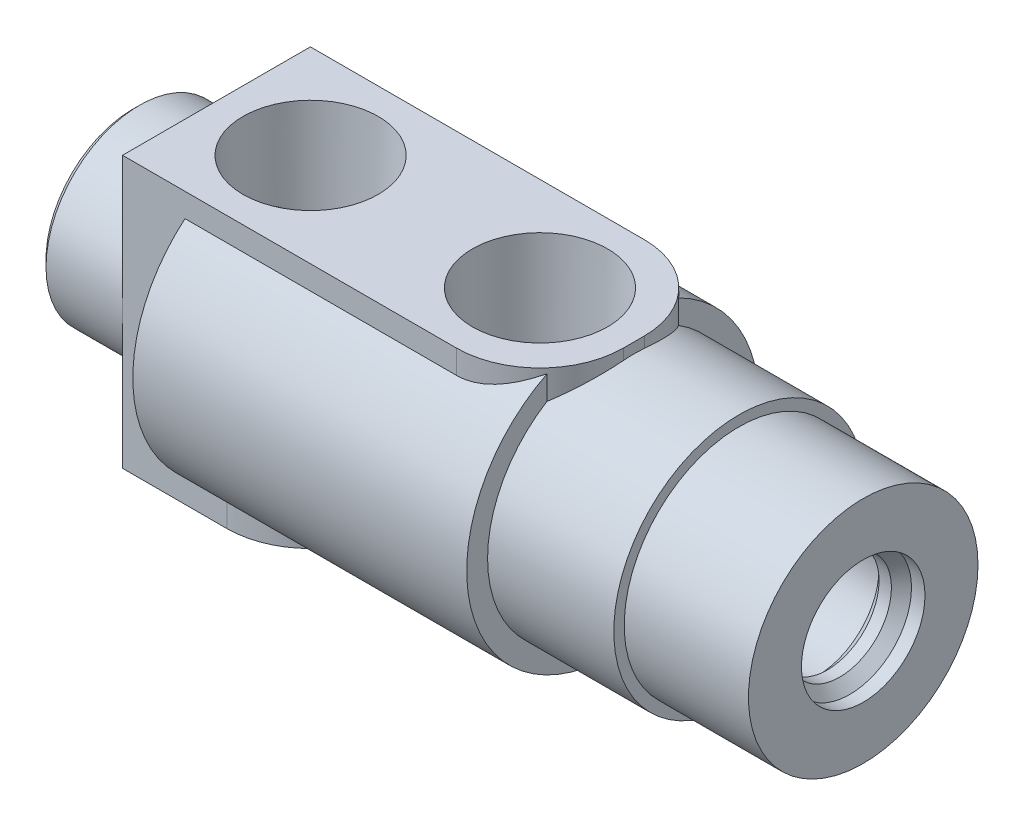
ISO-10303-21;
HEADER;
FILE_DESCRIPTION(('STEP AP214'),'2;1');
FILE_NAME('part.step','',(''),(''),'','','');
FILE_SCHEMA(('AUTOMOTIVE_DESIGN { 1 0 10303 214 1 1 1 1 }'));
ENDSEC;
DATA;
#1=APPLICATION_CONTEXT('core data for automotive mechanical design processes');
#2=APPLICATION_PROTOCOL_DEFINITION('international standard','automotive_design',2000,#1);
#3=PRODUCT_CONTEXT('',#1,'mechanical');
#4=PRODUCT('Part','Part','',(#3));
#5=PRODUCT_RELATED_PRODUCT_CATEGORY('part','',(#4));
#6=PRODUCT_DEFINITION_FORMATION('','',#4);
#7=PRODUCT_DEFINITION_CONTEXT('part definition',#1,'design');
#8=PRODUCT_DEFINITION('design','',#6,#7);
#9=PRODUCT_DEFINITION_SHAPE('','',#8);
#10=(LENGTH_UNIT() NAMED_UNIT(*) SI_UNIT(.MILLI.,.METRE.));
#11=(NAMED_UNIT(*) PLANE_ANGLE_UNIT() SI_UNIT($,.RADIAN.));
#12=(NAMED_UNIT(*) SI_UNIT($,.STERADIAN.) SOLID_ANGLE_UNIT());
#13=UNCERTAINTY_MEASURE_WITH_UNIT(LENGTH_MEASURE(1.E-05),#10,'distance_accuracy_value','');
#14=(GEOMETRIC_REPRESENTATION_CONTEXT(3) GLOBAL_UNCERTAINTY_ASSIGNED_CONTEXT((#13)) GLOBAL_UNIT_ASSIGNED_CONTEXT((#10,
#11,#12)) REPRESENTATION_CONTEXT('',''));
#15=CARTESIAN_POINT('',(0.,0.,0.));
#16=DIRECTION('',(0.,0.,1.));
#17=DIRECTION('',(1.,0.,0.));
#18=AXIS2_PLACEMENT_3D('',#15,#16,#17);
#19=CARTESIAN_POINT('',(-26.9446336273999,2.1335999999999,0.));
#20=DIRECTION('',(0.,-1.,0.));
#21=DIRECTION('',(0.,0.,-1.));
#22=AXIS2_PLACEMENT_3D('',#19,#20,#21);
#23=PLANE('',#22);
#24=CARTESIAN_POINT('',(-24.5872,2.13359999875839,0.));
#25=DIRECTION('',(0.,1.,0.));
#26=DIRECTION('',(0.,0.,1.));
#27=AXIS2_PLACEMENT_3D('',#24,#25,#26);
#28=CIRCLE('',#27,4.71486727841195);
#29=CARTESIAN_POINT('',(-28.6739587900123,2.13359999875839,2.35124989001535));
#30=VERTEX_POINT('',#29);
#31=CARTESIAN_POINT('',(-20.5004412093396,2.13359999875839,2.35124988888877));
#32=VERTEX_POINT('',#31);
#33=EDGE_CURVE('E187',#30,#32,#28,.T.);
#34=ORIENTED_EDGE('',*,*,#33,.T.);
#35=DIRECTION('',(-1.,0.,0.));
#36=VECTOR('',#35,1.);
#37=CARTESIAN_POINT('',(-36.9443,2.1335999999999,2.35124988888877));
#38=LINE('',#37,#36);
#39=CARTESIAN_POINT('',(-22.4915845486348,2.1335999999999,2.35124988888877));
#40=VERTEX_POINT('',#39);
#41=EDGE_CURVE('E192',#32,#40,#38,.T.);
#42=ORIENTED_EDGE('',*,*,#41,.T.);
#43=CARTESIAN_POINT('',(-24.5872,2.1335999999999,0.));
#44=DIRECTION('',(0.,-1.,0.));
#45=DIRECTION('',(0.,0.,-1.));
#46=AXIS2_PLACEMENT_3D('',#43,#44,#45);
#47=CIRCLE('',#46,3.1496);
#48=CARTESIAN_POINT('',(-26.6828154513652,2.1335999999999,2.35124988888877));
#49=VERTEX_POINT('',#48);
#50=EDGE_CURVE('E189',#49,#40,#47,.F.);
#51=ORIENTED_EDGE('',*,*,#50,.F.);
#52=EDGE_CURVE('E174',#49,#30,#38,.T.);
#53=ORIENTED_EDGE('',*,*,#52,.T.);
#54=EDGE_LOOP('',(#34,#42,#51,#53));
#55=FACE_BOUND('',#54,.T.);
#56=ADVANCED_FACE('F16',(#55),#23,.F.);
#57=CARTESIAN_POINT('',(-36.9443,4.21639999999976,0.));
#58=DIRECTION('',(1.,0.,0.));
#59=DIRECTION('',(0.,0.,-1.));
#60=AXIS2_PLACEMENT_3D('',#57,#58,#59);
#61=PLANE('',#60);
#62=CARTESIAN_POINT('',(-36.9443,-2.4980018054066E-13,0.));
#63=DIRECTION('',(-1.,0.,0.));
#64=DIRECTION('',(0.,0.,1.));
#65=AXIS2_PLACEMENT_3D('',#62,#63,#64);
#66=CIRCLE('',#65,4.2164);
#67=CARTESIAN_POINT('',(-36.9443,-2.4980018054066E-13,4.2164));
#68=VERTEX_POINT('',#67);
#69=EDGE_CURVE('E640',#68,#68,#66,.T.);
#70=ORIENTED_EDGE('',*,*,#69,.T.);
#71=EDGE_LOOP('',(#70));
#72=FACE_BOUND('',#71,.T.);
#73=CARTESIAN_POINT('',(-36.9443,-2.4980018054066E-13,0.));
#74=DIRECTION('',(-1.,0.,0.));
#75=DIRECTION('',(0.,0.,1.));
#76=AXIS2_PLACEMENT_3D('',#73,#74,#75);
#77=CIRCLE('',#76,3.9679118);
#78=CARTESIAN_POINT('',(-36.9443,-2.4980018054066E-13,3.9679118));
#79=VERTEX_POINT('',#78);
#80=EDGE_CURVE('E544',#79,#79,#77,.T.);
#81=ORIENTED_EDGE('',*,*,#80,.F.);
#82=EDGE_LOOP('',(#81));
#83=FACE_BOUND('',#82,.T.);
#84=ADVANCED_FACE('F240',(#72,#83),#61,.F.);
#85=CARTESIAN_POINT('',(-37.3221327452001,-2.1336,0.));
#86=DIRECTION('',(0.,1.,0.));
#87=DIRECTION('',(0.,0.,1.));
#88=AXIS2_PLACEMENT_3D('',#85,#86,#87);
#89=PLANE('',#88);
#90=CARTESIAN_POINT('',(-42.037,-2.13359999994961,1.20129600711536E-13));
#91=DIRECTION('',(0.,-1.,0.));
#92=DIRECTION('',(1.,0.,0.));
#93=AXIS2_PLACEMENT_3D('',#90,#91,#92);
#94=CIRCLE('',#93,4.71486725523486);
#95=CARTESIAN_POINT('',(-45.0376987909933,-2.13359999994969,-3.63672655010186));
#96=VERTEX_POINT('',#95);
#97=CARTESIAN_POINT('',(-39.0363012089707,-2.13359999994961,-3.63672655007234));
#98=VERTEX_POINT('',#97);
#99=EDGE_CURVE('E473',#96,#98,#94,.T.);
#100=ORIENTED_EDGE('',*,*,#99,.T.);
#101=DIRECTION('',(-1.,0.,0.));
#102=VECTOR('',#101,1.);
#103=CARTESIAN_POINT('',(-55.5625,-2.1336,-3.63672655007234));
#104=LINE('',#103,#102);
#105=EDGE_CURVE('E276',#98,#96,#104,.T.);
#106=ORIENTED_EDGE('',*,*,#105,.T.);
#107=EDGE_LOOP('',(#100,#106));
#108=FACE_BOUND('',#107,.T.);
#109=ADVANCED_FACE('F515',(#108),#89,.F.);
#110=CARTESIAN_POINT('',(-44.3944336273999,2.1335999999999,0.));
#111=DIRECTION('',(0.,-1.,0.));
#112=DIRECTION('',(0.,0.,-1.));
#113=AXIS2_PLACEMENT_3D('',#110,#111,#112);
#114=PLANE('',#113);
#115=CARTESIAN_POINT('',(-42.037,2.13359999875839,0.));
#116=DIRECTION('',(0.,1.,0.));
#117=DIRECTION('',(0.,0.,1.));
#118=AXIS2_PLACEMENT_3D('',#115,#116,#117);
#119=CIRCLE('',#118,4.71486727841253);
#120=CARTESIAN_POINT('',(-45.0376988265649,2.13359999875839,3.63672655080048));
#121=VERTEX_POINT('',#120);
#122=CARTESIAN_POINT('',(-39.0363011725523,2.13359999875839,3.63672655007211));
#123=VERTEX_POINT('',#122);
#124=EDGE_CURVE('E201',#121,#123,#119,.T.);
#125=ORIENTED_EDGE('',*,*,#124,.T.);
#126=DIRECTION('',(-1.,0.,0.));
#127=VECTOR('',#126,1.);
#128=CARTESIAN_POINT('',(-55.5625,2.1335999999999,3.63672655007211));
#129=LINE('',#128,#127);
#130=EDGE_CURVE('E255',#123,#121,#129,.T.);
#131=ORIENTED_EDGE('',*,*,#130,.T.);
#132=EDGE_LOOP('',(#125,#131));
#133=FACE_BOUND('',#132,.T.);
#134=ADVANCED_FACE('F529',(#133),#114,.F.);
#135=CARTESIAN_POINT('',(-6.44613890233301,0.,0.));
#136=DIRECTION('',(1.,0.,0.));
#137=DIRECTION('',(0.,0.,-1.));
#138=AXIS2_PLACEMENT_3D('',#135,#136,#137);
#139=CYLINDRICAL_SURFACE('',#138,4.699);
#140=CARTESIAN_POINT('',(-3.49346583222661,0.,0.));
#141=DIRECTION('',(-1.,0.,0.));
#142=DIRECTION('',(0.,0.,1.));
#143=AXIS2_PLACEMENT_3D('',#140,#141,#142);
#144=CIRCLE('',#143,4.69900001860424);
#145=CARTESIAN_POINT('',(-3.49346583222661,0.,4.69900001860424));
#146=VERTEX_POINT('',#145);
#147=EDGE_CURVE('E407',#146,#146,#144,.F.);
#148=ORIENTED_EDGE('',*,*,#147,.T.);
#149=EDGE_LOOP('',(#148));
#150=FACE_BOUND('',#149,.T.);
#151=CARTESIAN_POINT('',(-9.398811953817,0.,0.));
#152=DIRECTION('',(1.,0.,0.));
#153=DIRECTION('',(0.,0.,-1.));
#154=AXIS2_PLACEMENT_3D('',#151,#152,#153);
#155=CIRCLE('',#154,4.699);
#156=CARTESIAN_POINT('',(-9.398811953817,0.,-4.699));
#157=VERTEX_POINT('',#156);
#158=EDGE_CURVE('E622',#157,#157,#155,.F.);
#159=ORIENTED_EDGE('',*,*,#158,.T.);
#160=EDGE_LOOP('',(#159));
#161=FACE_BOUND('',#160,.T.);
#162=ADVANCED_FACE('F608',(#150,#161),#139,.F.);
#163=CARTESIAN_POINT('',(-3.4934658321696,0.,0.));
#164=DIRECTION('',(-1.,0.,0.));
#165=DIRECTION('',(0.,0.,1.));
#166=AXIS2_PLACEMENT_3D('',#163,#164,#165);
#167=CONICAL_SURFACE('',#166,4.6990000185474,0.785398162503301);
#168=CARTESIAN_POINT('',(-2.7305913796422,0.,0.));
#169=DIRECTION('',(1.,0.,0.));
#170=DIRECTION('',(0.,0.,-1.));
#171=AXIS2_PLACEMENT_3D('',#168,#169,#170);
#172=CIRCLE('',#171,3.93612552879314);
#173=CARTESIAN_POINT('',(-2.7305913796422,0.,-3.93612552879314));
#174=VERTEX_POINT('',#173);
#175=EDGE_CURVE('E212',#174,#174,#172,.T.);
#176=ORIENTED_EDGE('',*,*,#175,.T.);
#177=EDGE_LOOP('',(#176));
#178=FACE_BOUND('',#177,.T.);
#179=ORIENTED_EDGE('',*,*,#147,.F.);
#180=EDGE_LOOP('',(#179));
#181=FACE_BOUND('',#180,.T.);
#182=ADVANCED_FACE('F606',(#178,#181),#167,.F.);
#183=CARTESIAN_POINT('',(-9.398811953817,2.34949999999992,0.));
#184=DIRECTION('',(-1.,0.,0.));
#185=DIRECTION('',(0.,0.,1.));
#186=AXIS2_PLACEMENT_3D('',#183,#184,#185);
#187=PLANE('',#186);
#188=CARTESIAN_POINT('',(-9.398811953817,-2.4980018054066E-13,0.));
#189=DIRECTION('',(-1.,0.,0.));
#190=DIRECTION('',(0.,0.,1.));
#191=AXIS2_PLACEMENT_3D('',#188,#189,#190);
#192=CIRCLE('',#191,3.175);
#193=CARTESIAN_POINT('',(-9.398811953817,-2.4980018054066E-13,3.175));
#194=VERTEX_POINT('',#193);
#195=EDGE_CURVE('E536',#194,#194,#192,.T.);
#196=ORIENTED_EDGE('',*,*,#195,.T.);
#197=EDGE_LOOP('',(#196));
#198=FACE_BOUND('',#197,.T.);
#199=ORIENTED_EDGE('',*,*,#158,.F.);
#200=EDGE_LOOP('',(#199));
#201=FACE_BOUND('',#200,.T.);
#202=ADVANCED_FACE('F600',(#198,#201),#187,.F.);
#203=CARTESIAN_POINT('',(-24.5872,2.1335999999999,0.));
#204=DIRECTION('',(0.,-1.,0.));
#205=DIRECTION('',(0.,0.,-1.));
#206=AXIS2_PLACEMENT_3D('',#203,#204,#205);
#207=CYLINDRICAL_SURFACE('',#206,3.1496);
#208=CARTESIAN_POINT('',(-24.5872,2.1335999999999,0.));
#209=DIRECTION('',(0.,-1.,0.));
#210=DIRECTION('',(0.,0.,-1.));
#211=AXIS2_PLACEMENT_3D('',#208,#209,#210);
#212=CIRCLE('',#211,3.1496);
#213=CARTESIAN_POINT('',(-22.4915845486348,2.1335999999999,-2.35124988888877));
#214=VERTEX_POINT('',#213);
#215=CARTESIAN_POINT('',(-26.6828154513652,2.1335999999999,-2.35124988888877));
#216=VERTEX_POINT('',#215);
#217=EDGE_CURVE('E209',#214,#216,#212,.F.);
#218=ORIENTED_EDGE('',*,*,#217,.T.);
#219=CARTESIAN_POINT('',(-26.6828154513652,2.1335999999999,-2.35124988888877));
#220=CARTESIAN_POINT('',(-26.6015365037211,2.05379675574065,-2.42364263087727));
#221=CARTESIAN_POINT('',(-26.5178640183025,1.97175329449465,-2.49071125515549));
#222=CARTESIAN_POINT('',(-26.3465070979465,1.80428513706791,-2.61458342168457));
#223=CARTESIAN_POINT('',(-26.2588250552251,1.71886246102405,-2.67139298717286));
#224=CARTESIAN_POINT('',(-26.0817478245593,1.54721005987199,-2.77427262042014));
#225=CARTESIAN_POINT('',(-25.9924125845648,1.46102309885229,-2.82051884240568));
#226=CARTESIAN_POINT('',(-25.8108534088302,1.28734292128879,-2.90390114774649));
#227=CARTESIAN_POINT('',(-25.7186301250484,1.19985000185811,-2.94103927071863));
#228=CARTESIAN_POINT('',(-25.561437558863,1.05321408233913,-2.99588914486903));
#229=CARTESIAN_POINT('',(-25.4973063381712,0.994059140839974,-3.01599826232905));
#230=CARTESIAN_POINT('',(-25.3668126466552,0.876162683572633,-3.05234340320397));
#231=CARTESIAN_POINT('',(-25.3004385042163,0.817426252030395,-3.06855376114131));
#232=CARTESIAN_POINT('',(-25.164391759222,0.701714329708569,-3.09705336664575));
#233=CARTESIAN_POINT('',(-25.0946991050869,0.644754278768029,-3.1093139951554));
#234=CARTESIAN_POINT('',(-24.9859265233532,0.564852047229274,-3.12447011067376));
#235=CARTESIAN_POINT('',(-24.9490776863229,0.539208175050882,-3.12897448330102));
#236=CARTESIAN_POINT('',(-24.8731005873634,0.491420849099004,-3.13682984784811));
#237=CARTESIAN_POINT('',(-24.8339808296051,0.469265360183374,-3.1401848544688));
#238=CARTESIAN_POINT('',(-24.7683515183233,0.439299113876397,-3.1444836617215));
#239=CARTESIAN_POINT('',(-24.7429183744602,0.429271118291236,-3.14585700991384));
#240=CARTESIAN_POINT('',(-24.6908493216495,0.413255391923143,-3.14800103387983));
#241=CARTESIAN_POINT('',(-24.6642200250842,0.407247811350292,-3.14877467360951));
#242=CARTESIAN_POINT('',(-24.6098406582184,0.400534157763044,-3.14963690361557));
#243=CARTESIAN_POINT('',(-24.5820799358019,0.399906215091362,-3.14971539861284));
#244=CARTESIAN_POINT('',(-24.52700513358,0.40436076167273,-3.14914597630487));
#245=CARTESIAN_POINT('',(-24.4996922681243,0.409456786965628,-3.1484963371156));
#246=CARTESIAN_POINT('',(-24.4377280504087,0.426403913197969,-3.1462506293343));
#247=CARTESIAN_POINT('',(-24.4035670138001,0.439908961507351,-3.14441607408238));
#248=CARTESIAN_POINT('',(-24.3373606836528,0.471396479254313,-3.13985177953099));
#249=CARTESIAN_POINT('',(-24.3053291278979,0.489405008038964,-3.13711679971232));
#250=CARTESIAN_POINT('',(-24.2099133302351,0.548059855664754,-3.12759026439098));
#251=CARTESIAN_POINT('',(-24.1490870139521,0.592552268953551,-3.11956232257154));
#252=CARTESIAN_POINT('',(-24.0305517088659,0.684996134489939,-3.10059607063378));
#253=CARTESIAN_POINT('',(-23.9728524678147,0.732957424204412,-3.08964922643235));
#254=CARTESIAN_POINT('',(-23.8590934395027,0.830616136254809,-3.06484000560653));
#255=CARTESIAN_POINT('',(-23.8030423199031,0.880320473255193,-3.05096457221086));
#256=CARTESIAN_POINT('',(-23.6923410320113,0.980237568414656,-3.02034696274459));
#257=CARTESIAN_POINT('',(-23.6376892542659,1.03044964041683,-3.00360826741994));
#258=CARTESIAN_POINT('',(-23.4851715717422,1.1720712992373,-2.9523384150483));
#259=CARTESIAN_POINT('',(-23.3885117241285,1.26359440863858,-2.91445046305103));
#260=CARTESIAN_POINT('',(-23.1982975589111,1.44531775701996,-2.82874506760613));
#261=CARTESIAN_POINT('',(-23.1047450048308,1.53551722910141,-2.7809220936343));
#262=CARTESIAN_POINT('',(-22.922138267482,1.71247307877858,-2.67554747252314));
#263=CARTESIAN_POINT('',(-22.8330461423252,1.79925628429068,-2.6181076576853));
#264=CARTESIAN_POINT('',(-22.6590100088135,1.96932907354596,-2.49269114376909));
#265=CARTESIAN_POINT('',(-22.5740670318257,2.05261778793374,-2.42471184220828));
#266=CARTESIAN_POINT('',(-22.4915845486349,2.1336,-2.3512498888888));
#267=B_SPLINE_CURVE_WITH_KNOTS('',3,(#219,#220,#221,#222,#223,#224,#225,#226,#227,#228,#229,
#230,#231,#232,#233,#234,#235,#236,#237,#238,#239,#240,#241,#242,#243,#244,#245,#246,#247,#248,
#249,#250,#251,#252,#253,#254,#255,#256,#257,#258,#259,#260,#261,#262,#263,#264,#265,#266),
.UNSPECIFIED.,.F.,.F.,(4,2,2,2,2,2,2,2,2,2,2,2,2,2,2,2,2,2,2,2,2,2,2,4),(0.,0.404621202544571,
0.809004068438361,1.20604986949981,1.60300667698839,1.87150685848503,2.14172895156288,
2.4138671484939,2.54914447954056,2.68394435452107,2.76584070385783,2.84732966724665,
2.93000015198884,3.01286654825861,3.12258797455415,3.23295962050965,3.45972181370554,
3.68715440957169,3.91562325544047,4.14381631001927,4.55860406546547,4.97362334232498,
5.38411475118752,5.79470768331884),.UNSPECIFIED.);
#268=EDGE_CURVE('E190',#216,#214,#267,.T.);
#269=ORIENTED_EDGE('',*,*,#268,.T.);
#270=EDGE_LOOP('',(#218,#269));
#271=FACE_BOUND('',#270,.T.);
#272=ADVANCED_FACE('F596',(#271),#207,.F.);
#273=CARTESIAN_POINT('',(-24.5872,2.1335999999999,0.));
#274=DIRECTION('',(0.,-1.,0.));
#275=DIRECTION('',(0.,0.,-1.));
#276=AXIS2_PLACEMENT_3D('',#273,#274,#275);
#277=CYLINDRICAL_SURFACE('',#276,3.1496);
#278=ORIENTED_EDGE('',*,*,#50,.T.);
#279=CARTESIAN_POINT('',(-22.4915845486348,2.1335999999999,2.35124988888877));
#280=CARTESIAN_POINT('',(-22.5728634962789,2.05379675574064,2.42364263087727));
#281=CARTESIAN_POINT('',(-22.6565359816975,1.97175329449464,2.4907112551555));
#282=CARTESIAN_POINT('',(-22.8278929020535,1.80428513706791,2.61458342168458));
#283=CARTESIAN_POINT('',(-22.9155749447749,1.71886246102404,2.67139298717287));
#284=CARTESIAN_POINT('',(-23.0926521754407,1.54721005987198,2.77427262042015));
#285=CARTESIAN_POINT('',(-23.1819874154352,1.46102309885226,2.82051884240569));
#286=CARTESIAN_POINT('',(-23.3635465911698,1.28734292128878,2.90390114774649));
#287=CARTESIAN_POINT('',(-23.4557698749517,1.19985000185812,2.94103927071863));
#288=CARTESIAN_POINT('',(-23.612962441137,1.05321408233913,2.99588914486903));
#289=CARTESIAN_POINT('',(-23.6770936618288,0.994059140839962,3.01599826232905));
#290=CARTESIAN_POINT('',(-23.8075873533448,0.876162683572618,3.05234340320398));
#291=CARTESIAN_POINT('',(-23.8739614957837,0.81742625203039,3.06855376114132));
#292=CARTESIAN_POINT('',(-24.010008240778,0.70171432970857,3.09705336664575));
#293=CARTESIAN_POINT('',(-24.0797008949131,0.644754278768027,3.1093139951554));
#294=CARTESIAN_POINT('',(-24.1884734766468,0.56485204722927,3.12447011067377));
#295=CARTESIAN_POINT('',(-24.2253223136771,0.539208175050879,3.12897448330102));
#296=CARTESIAN_POINT('',(-24.3012994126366,0.491420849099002,3.13682984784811));
#297=CARTESIAN_POINT('',(-24.3404191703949,0.469265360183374,3.1401848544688));
#298=CARTESIAN_POINT('',(-24.4060484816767,0.439299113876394,3.14448366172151));
#299=CARTESIAN_POINT('',(-24.4314816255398,0.42927111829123,3.14585700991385));
#300=CARTESIAN_POINT('',(-24.4835506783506,0.413255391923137,3.14800103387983));
#301=CARTESIAN_POINT('',(-24.5101799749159,0.40724781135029,3.14877467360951));
#302=CARTESIAN_POINT('',(-24.5645593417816,0.400534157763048,3.14963690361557));
#303=CARTESIAN_POINT('',(-24.5923200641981,0.399906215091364,3.14971539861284));
#304=CARTESIAN_POINT('',(-24.64739486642,0.404360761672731,3.14914597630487));
#305=CARTESIAN_POINT('',(-24.6747077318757,0.40945678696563,3.1484963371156));
#306=CARTESIAN_POINT('',(-24.7366719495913,0.42640391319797,3.1462506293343));
#307=CARTESIAN_POINT('',(-24.7708329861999,0.439908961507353,3.14441607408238));
#308=CARTESIAN_POINT('',(-24.8370393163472,0.471396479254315,3.13985177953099));
#309=CARTESIAN_POINT('',(-24.8690708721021,0.489405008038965,3.13711679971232));
#310=CARTESIAN_POINT('',(-24.9644866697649,0.548059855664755,3.12759026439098));
#311=CARTESIAN_POINT('',(-25.0253129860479,0.592552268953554,3.11956232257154));
#312=CARTESIAN_POINT('',(-25.1438482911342,0.684996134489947,3.10059607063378));
#313=CARTESIAN_POINT('',(-25.2015475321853,0.732957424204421,3.08964922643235));
#314=CARTESIAN_POINT('',(-25.3153065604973,0.830616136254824,3.06484000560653));
#315=CARTESIAN_POINT('',(-25.3713576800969,0.880320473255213,3.05096457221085));
#316=CARTESIAN_POINT('',(-25.4820589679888,0.980237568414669,3.02034696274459));
#317=CARTESIAN_POINT('',(-25.5367107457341,1.03044964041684,3.00360826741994));
#318=CARTESIAN_POINT('',(-25.6892284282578,1.17207129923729,2.9523384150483));
#319=CARTESIAN_POINT('',(-25.7858882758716,1.26359440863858,2.91445046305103));
#320=CARTESIAN_POINT('',(-25.9761024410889,1.44531775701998,2.82874506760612));
#321=CARTESIAN_POINT('',(-26.0696549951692,1.53551722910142,2.7809220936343));
#322=CARTESIAN_POINT('',(-26.252261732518,1.71247307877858,2.67554747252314));
#323=CARTESIAN_POINT('',(-26.3413538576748,1.79925628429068,2.6181076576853));
#324=CARTESIAN_POINT('',(-26.5153899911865,1.96932907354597,2.49269114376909));
#325=CARTESIAN_POINT('',(-26.6003329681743,2.05261778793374,2.42471184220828));
#326=CARTESIAN_POINT('',(-26.6828154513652,2.1336,2.3512498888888));
#327=B_SPLINE_CURVE_WITH_KNOTS('',3,(#279,#280,#281,#282,#283,#284,#285,#286,#287,#288,#289,
#290,#291,#292,#293,#294,#295,#296,#297,#298,#299,#300,#301,#302,#303,#304,#305,#306,#307,#308,
#309,#310,#311,#312,#313,#314,#315,#316,#317,#318,#319,#320,#321,#322,#323,#324,#325,#326),
.UNSPECIFIED.,.F.,.F.,(4,2,2,2,2,2,2,2,2,2,2,2,2,2,2,2,2,2,2,2,2,2,2,4),(0.,0.404621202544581,
0.809004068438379,1.20604986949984,1.60300667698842,1.87150685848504,2.14172895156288,
2.4138671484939,2.54914447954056,2.68394435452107,2.76584070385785,2.8473296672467,
2.93000015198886,3.0128665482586,3.12258797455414,3.23295962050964,3.45972181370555,
3.68715440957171,3.91562325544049,4.14381631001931,4.55860406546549,4.97362334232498,
5.38411475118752,5.79470768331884),.UNSPECIFIED.);
#328=EDGE_CURVE('E534',#40,#49,#327,.T.);
#329=ORIENTED_EDGE('',*,*,#328,.T.);
#330=EDGE_LOOP('',(#278,#329));
#331=FACE_BOUND('',#330,.T.);
#332=ADVANCED_FACE('F599',(#331),#277,.F.);
#333=CARTESIAN_POINT('',(-1.28877937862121,0.,0.));
#334=DIRECTION('',(1.,0.,0.));
#335=DIRECTION('',(0.,0.,-1.));
#336=AXIS2_PLACEMENT_3D('',#333,#334,#335);
#337=CYLINDRICAL_SURFACE('',#336,3.93612552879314);
#338=ORIENTED_EDGE('',*,*,#175,.F.);
#339=EDGE_LOOP('',(#338));
#340=FACE_BOUND('',#339,.T.);
#341=CARTESIAN_POINT('',(-1.79006741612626,0.,0.));
#342=DIRECTION('',(1.,0.,0.));
#343=DIRECTION('',(0.,1.,0.));
#344=AXIS2_PLACEMENT_3D('',#341,#342,#343);
#345=CIRCLE('',#344,3.93612552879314);
#346=CARTESIAN_POINT('',(-1.79006741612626,3.93612552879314,0.));
#347=VERTEX_POINT('',#346);
#348=EDGE_CURVE('E20',#347,#347,#345,.T.);
#349=ORIENTED_EDGE('',*,*,#348,.T.);
#350=EDGE_LOOP('',(#349));
#351=FACE_BOUND('',#350,.T.);
#352=ADVANCED_FACE('F18',(#340,#351),#337,.F.);
#353=CARTESIAN_POINT('',(-39.0363011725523,2.13359999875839,-3.63672655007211));
#354=VERTEX_POINT('',#353);
#355=CARTESIAN_POINT('',(-45.0376988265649,2.13359999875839,-3.63672655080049));
#356=VERTEX_POINT('',#355);
#357=EDGE_CURVE('E197',#354,#356,#119,.T.);
#358=ORIENTED_EDGE('',*,*,#357,.T.);
#359=DIRECTION('',(-1.,0.,0.));
#360=VECTOR('',#359,1.);
#361=CARTESIAN_POINT('',(-55.5625,2.1335999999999,-3.63672655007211));
#362=LINE('',#361,#360);
#363=EDGE_CURVE('E642',#356,#354,#362,.F.);
#364=ORIENTED_EDGE('',*,*,#363,.T.);
#365=EDGE_LOOP('',(#358,#364));
#366=FACE_BOUND('',#365,.T.);
#367=ADVANCED_FACE('F520',(#366),#114,.F.);
#368=CARTESIAN_POINT('',(-20.5004412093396,2.13359999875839,-2.35124988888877));
#369=VERTEX_POINT('',#368);
#370=CARTESIAN_POINT('',(-28.6739587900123,2.13359999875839,-2.35124989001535));
#371=VERTEX_POINT('',#370);
#372=EDGE_CURVE('E196',#369,#371,#28,.T.);
#373=ORIENTED_EDGE('',*,*,#372,.T.);
#374=DIRECTION('',(-1.,0.,0.));
#375=VECTOR('',#374,1.);
#376=CARTESIAN_POINT('',(-36.9443,2.1335999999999,-2.35124988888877));
#377=LINE('',#376,#375);
#378=EDGE_CURVE('E33',#371,#216,#377,.F.);
#379=ORIENTED_EDGE('',*,*,#378,.T.);
#380=ORIENTED_EDGE('',*,*,#217,.F.);
#381=EDGE_CURVE('E532',#214,#369,#377,.F.);
#382=ORIENTED_EDGE('',*,*,#381,.T.);
#383=EDGE_LOOP('',(#373,#379,#380,#382));
#384=FACE_BOUND('',#383,.T.);
#385=ADVANCED_FACE('F510',(#384),#23,.F.);
#386=CARTESIAN_POINT('',(-39.0363012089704,-2.13359999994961,3.63672655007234));
#387=VERTEX_POINT('',#386);
#388=CARTESIAN_POINT('',(-45.0376987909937,-2.13359999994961,3.63672655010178));
#389=VERTEX_POINT('',#388);
#390=EDGE_CURVE('E204',#387,#389,#94,.T.);
#391=ORIENTED_EDGE('',*,*,#390,.T.);
#392=DIRECTION('',(-1.,0.,0.));
#393=VECTOR('',#392,1.);
#394=CARTESIAN_POINT('',(-55.5625,-2.1336,3.63672655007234));
#395=LINE('',#394,#393);
#396=EDGE_CURVE('E41',#389,#387,#395,.F.);
#397=ORIENTED_EDGE('',*,*,#396,.T.);
#398=EDGE_LOOP('',(#391,#397));
#399=FACE_BOUND('',#398,.T.);
#400=ADVANCED_FACE('F505',(#399),#89,.F.);
#401=CARTESIAN_POINT('',(-1.02719290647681,0.,0.));
#402=DIRECTION('',(1.,0.,0.));
#403=DIRECTION('',(0.,1.,0.));
#404=AXIS2_PLACEMENT_3D('',#401,#402,#403);
#405=CONICAL_SURFACE('',#404,4.69900003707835,0.785398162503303);
#406=ORIENTED_EDGE('',*,*,#348,.F.);
#407=EDGE_LOOP('',(#406));
#408=FACE_BOUND('',#407,.T.);
#409=CARTESIAN_POINT('',(-1.02719290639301,0.,0.));
#410=DIRECTION('',(1.,0.,0.));
#411=DIRECTION('',(0.,0.,-1.));
#412=AXIS2_PLACEMENT_3D('',#409,#410,#411);
#413=CIRCLE('',#412,4.69899999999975);
#414=CARTESIAN_POINT('',(-1.02719290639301,0.,-4.69899999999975));
#415=VERTEX_POINT('',#414);
#416=EDGE_CURVE('E470',#415,#415,#413,.T.);
#417=ORIENTED_EDGE('',*,*,#416,.T.);
#418=EDGE_LOOP('',(#417));
#419=FACE_BOUND('',#418,.T.);
#420=ADVANCED_FACE('F497',(#408,#419),#405,.F.);
#421=CARTESIAN_POINT('',(-42.037,10.3123999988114,0.));
#422=DIRECTION('',(0.,1.,0.));
#423=DIRECTION('',(0.,0.,1.));
#424=AXIS2_PLACEMENT_3D('',#421,#422,#423);
#425=CONICAL_SURFACE('',#424,5.14350002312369,0.0523598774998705);
#426=ORIENTED_EDGE('',*,*,#357,.F.);
#427=CARTESIAN_POINT('',(-39.0364598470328,2.13339999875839,-3.63684387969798));
#428=CARTESIAN_POINT('',(-38.9860398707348,2.19693999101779,-3.59956421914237));
#429=CARTESIAN_POINT('',(-38.9356519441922,2.25951664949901,-3.56062464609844));
#430=CARTESIAN_POINT('',(-38.8352185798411,2.38274296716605,-3.47937119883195));
#431=CARTESIAN_POINT('',(-38.7851731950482,2.44339233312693,-3.43705681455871));
#432=CARTESIAN_POINT('',(-38.6357003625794,2.62276997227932,-3.30472962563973));
#433=CARTESIAN_POINT('',(-38.5372348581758,2.73855554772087,-3.20955046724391));
#434=CARTESIAN_POINT('',(-38.3440685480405,2.96267961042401,-3.00398606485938));
#435=CARTESIAN_POINT('',(-38.2494218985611,3.07092077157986,-2.89344324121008));
#436=CARTESIAN_POINT('',(-38.0675387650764,3.27695205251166,-2.65782927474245));
#437=CARTESIAN_POINT('',(-37.9802912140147,3.37475783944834,-2.53278051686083));
#438=CARTESIAN_POINT('',(-37.8012625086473,3.57410375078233,-2.24489940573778));
#439=CARTESIAN_POINT('',(-37.7113317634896,3.67333512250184,-2.07927818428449));
#440=CARTESIAN_POINT('',(-37.5499998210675,3.85045764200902,-1.72922018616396));
#441=CARTESIAN_POINT('',(-37.4785309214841,3.92842682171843,-1.5448557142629));
#442=CARTESIAN_POINT('',(-37.3883779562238,4.0264895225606,-1.25539015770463));
#443=CARTESIAN_POINT('',(-37.3610555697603,4.05615019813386,-1.15610375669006));
#444=CARTESIAN_POINT('',(-37.3129213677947,4.10834133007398,-0.954155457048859));
#445=CARTESIAN_POINT('',(-37.2921060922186,4.13087557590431,-0.851495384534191));
#446=CARTESIAN_POINT('',(-37.2574878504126,4.16832449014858,-0.643628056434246));
#447=CARTESIAN_POINT('',(-37.24368497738,4.1832390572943,-0.538420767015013));
#448=CARTESIAN_POINT('',(-37.2234561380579,4.20508970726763,-0.326481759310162));
#449=CARTESIAN_POINT('',(-37.2170289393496,4.21202712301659,-0.219750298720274));
#450=CARTESIAN_POINT('',(-37.2121035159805,4.21734372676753,-0.0211955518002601));
#451=CARTESIAN_POINT('',(-37.2126027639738,4.21680500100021,0.0705767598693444));
#452=CARTESIAN_POINT('',(-37.2191318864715,4.20975683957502,0.253724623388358));
#453=CARTESIAN_POINT('',(-37.2251634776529,4.20324555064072,0.345100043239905));
#454=CARTESIAN_POINT('',(-37.2426363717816,4.18437166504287,0.526675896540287));
#455=CARTESIAN_POINT('',(-37.2540750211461,4.17201193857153,0.616876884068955));
#456=CARTESIAN_POINT('',(-37.2821334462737,4.1416663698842,0.795521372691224));
#457=CARTESIAN_POINT('',(-37.2987552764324,4.12367829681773,0.883964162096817));
#458=CARTESIAN_POINT('',(-37.3546215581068,4.06314862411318,1.13960867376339));
#459=CARTESIAN_POINT('',(-37.400543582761,4.01331428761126,1.30371485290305));
#460=CARTESIAN_POINT('',(-37.507868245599,3.89640049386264,1.62007172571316));
#461=CARTESIAN_POINT('',(-37.5692740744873,3.8293174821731,1.7723199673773));
#462=CARTESIAN_POINT('',(-37.7343158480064,3.64806913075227,2.12715228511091));
#463=CARTESIAN_POINT('',(-37.8446791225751,3.52614021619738,2.32265393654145));
#464=CARTESIAN_POINT('',(-38.0837712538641,3.25886075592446,2.68492823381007));
#465=CARTESIAN_POINT('',(-38.2125613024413,3.11343195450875,2.85160089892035));
#466=CARTESIAN_POINT('',(-38.4019677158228,2.89557172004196,3.066201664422));
#467=CARTESIAN_POINT('',(-38.4580051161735,2.83065985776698,3.1261985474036));
#468=CARTESIAN_POINT('',(-38.5715462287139,2.69793554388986,3.2414343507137));
#469=CARTESIAN_POINT('',(-38.6290498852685,2.63012320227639,3.29667345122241));
#470=CARTESIAN_POINT('',(-38.7446072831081,2.49232666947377,3.40202967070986));
#471=CARTESIAN_POINT('',(-38.802652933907,2.42236421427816,3.45218425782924));
#472=CARTESIAN_POINT('',(-38.9192724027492,2.27982842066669,3.54792290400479));
#473=CARTESIAN_POINT('',(-38.9778461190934,2.20725557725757,3.59350782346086));
#474=CARTESIAN_POINT('',(-39.0364598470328,2.13339999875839,3.63684387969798));
#475=B_SPLINE_CURVE_WITH_KNOTS('',3,(#427,#428,#429,#430,#431,#432,#433,#434,#435,#436,#437,
#438,#439,#440,#441,#442,#443,#444,#445,#446,#447,#448,#449,#450,#451,#452,#453,#454,#455,#456,
#457,#458,#459,#460,#461,#462,#463,#464,#465,#466,#467,#468,#469,#470,#471,#472,#473,#474),
.UNSPECIFIED.,.F.,.F.,(4,2,2,2,2,2,2,2,2,2,2,2,2,2,2,2,2,2,2,2,2,2,2,4),(0.,0.267769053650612,
0.53557865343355,1.07276591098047,1.61593725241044,2.15828127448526,2.79494588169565,
3.42924149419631,3.75032317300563,4.07123382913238,4.39214875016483,4.71301004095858,
4.98798216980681,5.26303965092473,5.53796228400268,5.8129940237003,6.34331420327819,
6.87374375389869,7.63599980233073,8.40084858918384,8.71471401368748,9.02856754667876,
9.33990820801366,9.65119013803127),.UNSPECIFIED.);
#476=EDGE_CURVE('E181',#354,#123,#475,.T.);
#477=ORIENTED_EDGE('',*,*,#476,.T.);
#478=ORIENTED_EDGE('',*,*,#124,.F.);
#479=CARTESIAN_POINT('',(-45.0375401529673,2.13339999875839,3.63684387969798));
#480=CARTESIAN_POINT('',(-45.0879601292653,2.1969399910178,3.59956421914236));
#481=CARTESIAN_POINT('',(-45.1383480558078,2.25951664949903,3.56062464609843));
#482=CARTESIAN_POINT('',(-45.2387814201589,2.38274296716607,3.47937119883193));
#483=CARTESIAN_POINT('',(-45.2888268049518,2.44339233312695,3.43705681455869));
#484=CARTESIAN_POINT('',(-45.4382996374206,2.62276997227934,3.30472962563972));
#485=CARTESIAN_POINT('',(-45.5367651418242,2.73855554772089,3.2095504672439));
#486=CARTESIAN_POINT('',(-45.7299314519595,2.96267961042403,3.00398606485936));
#487=CARTESIAN_POINT('',(-45.8245781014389,3.07092077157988,2.89344324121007));
#488=CARTESIAN_POINT('',(-46.0064612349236,3.27695205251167,2.65782927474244));
#489=CARTESIAN_POINT('',(-46.0937087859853,3.37475783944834,2.53278051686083));
#490=CARTESIAN_POINT('',(-46.2727374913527,3.57410375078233,2.24489940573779));
#491=CARTESIAN_POINT('',(-46.3626682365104,3.67333512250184,2.0792781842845));
#492=CARTESIAN_POINT('',(-46.5240001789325,3.85045764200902,1.72922018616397));
#493=CARTESIAN_POINT('',(-46.5954690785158,3.92842682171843,1.54485571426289));
#494=CARTESIAN_POINT('',(-46.6856220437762,4.0264895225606,1.25539015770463));
#495=CARTESIAN_POINT('',(-46.7129444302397,4.05615019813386,1.15610375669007));
#496=CARTESIAN_POINT('',(-46.7610786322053,4.10834133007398,0.954155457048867));
#497=CARTESIAN_POINT('',(-46.7818939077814,4.13087557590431,0.851495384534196));
#498=CARTESIAN_POINT('',(-46.8165121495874,4.16832449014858,0.643628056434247));
#499=CARTESIAN_POINT('',(-46.83031502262,4.18323905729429,0.538420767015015));
#500=CARTESIAN_POINT('',(-46.8505438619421,4.20508970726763,0.326481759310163));
#501=CARTESIAN_POINT('',(-46.8569710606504,4.21202712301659,0.219750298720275));
#502=CARTESIAN_POINT('',(-46.8618964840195,4.21734372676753,0.0211955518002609));
#503=CARTESIAN_POINT('',(-46.8613972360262,4.21680500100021,-0.0705767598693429));
#504=CARTESIAN_POINT('',(-46.8548681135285,4.20975683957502,-0.253724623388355));
#505=CARTESIAN_POINT('',(-46.8488365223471,4.20324555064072,-0.345100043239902));
#506=CARTESIAN_POINT('',(-46.8313636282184,4.18437166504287,-0.526675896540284));
#507=CARTESIAN_POINT('',(-46.8199249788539,4.17201193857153,-0.616876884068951));
#508=CARTESIAN_POINT('',(-46.7918665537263,4.1416663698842,-0.795521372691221));
#509=CARTESIAN_POINT('',(-46.7752447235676,4.12367829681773,-0.883964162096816));
#510=CARTESIAN_POINT('',(-46.7193784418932,4.06314862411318,-1.13960867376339));
#511=CARTESIAN_POINT('',(-46.673456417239,4.01331428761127,-1.30371485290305));
#512=CARTESIAN_POINT('',(-46.566131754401,3.89640049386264,-1.62007172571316));
#513=CARTESIAN_POINT('',(-46.5047259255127,3.8293174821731,-1.7723199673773));
#514=CARTESIAN_POINT('',(-46.3396841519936,3.64806913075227,-2.12715228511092));
#515=CARTESIAN_POINT('',(-46.2293208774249,3.52614021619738,-2.32265393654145));
#516=CARTESIAN_POINT('',(-45.9902287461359,3.25886075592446,-2.68492823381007));
#517=CARTESIAN_POINT('',(-45.8614386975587,3.11343195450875,-2.85160089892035));
#518=CARTESIAN_POINT('',(-45.6720322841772,2.89557172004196,-3.066201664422));
#519=CARTESIAN_POINT('',(-45.6159948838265,2.83065985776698,-3.1261985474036));
#520=CARTESIAN_POINT('',(-45.5024537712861,2.69793554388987,-3.24143435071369));
#521=CARTESIAN_POINT('',(-45.4449501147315,2.6301232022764,-3.29667345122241));
#522=CARTESIAN_POINT('',(-45.329392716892,2.49232666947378,-3.40202967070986));
#523=CARTESIAN_POINT('',(-45.271347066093,2.42236421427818,-3.45218425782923));
#524=CARTESIAN_POINT('',(-45.1547275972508,2.2798284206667,-3.54792290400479));
#525=CARTESIAN_POINT('',(-45.0961538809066,2.20725557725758,-3.59350782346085));
#526=CARTESIAN_POINT('',(-45.0375401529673,2.13339999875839,-3.63684387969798));
#527=B_SPLINE_CURVE_WITH_KNOTS('',3,(#479,#480,#481,#482,#483,#484,#485,#486,#487,#488,#489,
#490,#491,#492,#493,#494,#495,#496,#497,#498,#499,#500,#501,#502,#503,#504,#505,#506,#507,#508,
#509,#510,#511,#512,#513,#514,#515,#516,#517,#518,#519,#520,#521,#522,#523,#524,#525,#526),
.UNSPECIFIED.,.F.,.F.,(4,2,2,2,2,2,2,2,2,2,2,2,2,2,2,2,2,2,2,2,2,2,2,4),(0.,0.267769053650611,
0.535578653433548,1.07276591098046,1.61593725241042,2.15828127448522,2.79494588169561,
3.42924149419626,3.75032317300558,4.07123382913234,4.39214875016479,4.71301004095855,
4.98798216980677,5.26303965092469,5.53796228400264,5.81299402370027,6.34331420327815,
6.87374375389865,7.63599980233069,8.40084858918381,8.71471401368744,9.02856754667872,
9.33990820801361,9.6511901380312),.UNSPECIFIED.);
#528=EDGE_CURVE('E213',#121,#356,#527,.T.);
#529=ORIENTED_EDGE('',*,*,#528,.T.);
#530=EDGE_LOOP('',(#426,#477,#478,#529));
#531=FACE_BOUND('',#530,.T.);
#532=CARTESIAN_POINT('',(-42.037,10.3123999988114,0.));
#533=DIRECTION('',(0.,1.,0.));
#534=DIRECTION('',(0.,0.,1.));
#535=AXIS2_PLACEMENT_3D('',#532,#533,#534);
#536=CIRCLE('',#535,5.14350002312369);
#537=CARTESIAN_POINT('',(-42.037,10.3123999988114,5.14350002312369));
#538=VERTEX_POINT('',#537);
#539=EDGE_CURVE('E469',#538,#538,#536,.F.);
#540=ORIENTED_EDGE('',*,*,#539,.F.);
#541=EDGE_LOOP('',(#540));
#542=FACE_BOUND('',#541,.T.);
#543=ADVANCED_FACE('F227',(#531,#542),#425,.F.);
#544=CARTESIAN_POINT('',(-24.5872,10.3123999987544,0.));
#545=DIRECTION('',(0.,1.,0.));
#546=DIRECTION('',(0.,0.,1.));
#547=AXIS2_PLACEMENT_3D('',#544,#545,#546);
#548=CONICAL_SURFACE('',#547,5.14350002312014,0.0523598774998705);
#549=ORIENTED_EDGE('',*,*,#372,.F.);
#550=CARTESIAN_POINT('',(-20.6268346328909,1.90939923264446,-2.53669461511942));
#551=CARTESIAN_POINT('',(-20.5878346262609,1.98101260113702,-2.48277680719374));
#552=CARTESIAN_POINT('',(-20.5487431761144,2.05033225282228,-2.42586022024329));
#553=CARTESIAN_POINT('',(-20.471161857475,2.18413827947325,-2.30613294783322));
#554=CARTESIAN_POINT('',(-20.4326724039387,2.24862142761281,-2.24331838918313));
#555=CARTESIAN_POINT('',(-20.356745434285,2.3730486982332,-2.11129594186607));
#556=CARTESIAN_POINT('',(-20.3193227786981,2.43293941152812,-2.04202902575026));
#557=CARTESIAN_POINT('',(-20.2467563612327,2.54701305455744,-1.89784069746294));
#558=CARTESIAN_POINT('',(-20.2116122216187,2.60119693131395,-1.82292022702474));
#559=CARTESIAN_POINT('',(-20.1442184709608,2.70363449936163,-1.66724648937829));
#560=CARTESIAN_POINT('',(-20.1119849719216,2.75185566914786,-1.58646474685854));
#561=CARTESIAN_POINT('',(-20.0514314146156,2.84143632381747,-1.4197928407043));
#562=CARTESIAN_POINT('',(-20.0231106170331,2.88279710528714,-1.33390364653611));
#563=CARTESIAN_POINT('',(-19.9712680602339,2.95787138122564,-1.15790128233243));
#564=CARTESIAN_POINT('',(-19.9477266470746,2.99161626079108,-1.06780736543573));
#565=CARTESIAN_POINT('',(-19.906017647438,3.05104350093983,-0.883797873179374));
#566=CARTESIAN_POINT('',(-19.8878486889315,3.076727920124,-0.789883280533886));
#567=CARTESIAN_POINT('',(-19.8597137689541,3.11634787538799,-0.613154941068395));
#568=CARTESIAN_POINT('',(-19.8489359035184,3.13145354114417,-0.530731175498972));
#569=CARTESIAN_POINT('',(-19.8320137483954,3.15512621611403,-0.364486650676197));
#570=CARTESIAN_POINT('',(-19.8258686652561,3.16369434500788,-0.280666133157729));
#571=CARTESIAN_POINT('',(-19.8183813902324,3.17413008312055,-0.112375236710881));
#572=CARTESIAN_POINT('',(-19.817039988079,3.17599659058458,-0.0279047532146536));
#573=CARTESIAN_POINT('',(-19.819191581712,3.17299927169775,0.14082746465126));
#574=CARTESIAN_POINT('',(-19.8226841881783,3.16813598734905,0.22508921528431));
#575=CARTESIAN_POINT('',(-19.8387618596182,3.14570323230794,0.454416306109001));
#576=CARTESIAN_POINT('',(-19.8561486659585,3.12141415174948,0.598562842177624));
#577=CARTESIAN_POINT('',(-19.9039018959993,3.05405949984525,0.879958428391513));
#578=CARTESIAN_POINT('',(-19.9342645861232,3.0109993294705,1.01720944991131));
#579=CARTESIAN_POINT('',(-20.0072868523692,2.90593071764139,1.287670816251));
#580=CARTESIAN_POINT('',(-20.05040269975,2.84321284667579,1.42047986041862));
#581=CARTESIAN_POINT('',(-20.1455859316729,2.70178812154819,1.67394487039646));
#582=CARTESIAN_POINT('',(-20.1976667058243,2.62305731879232,1.79458222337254));
#583=CARTESIAN_POINT('',(-20.3109209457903,2.44683318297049,2.02886834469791));
#584=CARTESIAN_POINT('',(-20.3724409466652,2.34853400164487,2.1417432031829));
#585=CARTESIAN_POINT('',(-20.4669205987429,2.19105236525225,2.29899958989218));
#586=CARTESIAN_POINT('',(-20.4987257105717,2.13698455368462,2.34933531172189));
#587=CARTESIAN_POINT('',(-20.5626507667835,2.02560179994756,2.44601398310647));
#588=CARTESIAN_POINT('',(-20.5947706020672,1.96828795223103,2.49235826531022));
#589=CARTESIAN_POINT('',(-20.6268346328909,1.90939923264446,2.53669461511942));
#590=B_SPLINE_CURVE_WITH_KNOTS('',3,(#550,#551,#552,#553,#554,#555,#556,#557,#558,#559,#560,
#561,#562,#563,#564,#565,#566,#567,#568,#569,#570,#571,#572,#573,#574,#575,#576,#577,#578,#579,
#580,#581,#582,#583,#584,#585,#586,#587,#588,#589),.UNSPECIFIED.,.F.,.F.,(4,2,2,2,2,2,2,2,2,2,2,
2,2,2,2,2,2,2,2,4),(0.,0.2932168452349,0.586627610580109,0.883051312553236,1.17942574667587,
1.47735133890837,1.7752205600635,2.07183888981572,2.36838140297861,2.62146893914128,
2.87451311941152,3.12759889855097,3.38066429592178,3.82008980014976,4.25938895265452,
4.71684010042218,5.17498050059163,5.6588711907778,5.90001573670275,6.14107945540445),.UNSPECIFIED.);
#591=EDGE_CURVE('E180',#369,#32,#590,.T.);
#592=ORIENTED_EDGE('',*,*,#591,.T.);
#593=ORIENTED_EDGE('',*,*,#33,.F.);
#594=CARTESIAN_POINT('',(-28.5475653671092,1.90939923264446,2.53669461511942));
#595=CARTESIAN_POINT('',(-28.5865653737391,1.98101260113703,2.48277680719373));
#596=CARTESIAN_POINT('',(-28.6256568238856,2.05033225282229,2.42586022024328));
#597=CARTESIAN_POINT('',(-28.703238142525,2.18413827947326,2.30613294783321));
#598=CARTESIAN_POINT('',(-28.7417275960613,2.24862142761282,2.24331838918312));
#599=CARTESIAN_POINT('',(-28.817654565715,2.3730486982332,2.11129594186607));
#600=CARTESIAN_POINT('',(-28.8550772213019,2.43293941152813,2.04202902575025));
#601=CARTESIAN_POINT('',(-28.9276436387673,2.54701305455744,1.89784069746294));
#602=CARTESIAN_POINT('',(-28.9627877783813,2.60119693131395,1.82292022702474));
#603=CARTESIAN_POINT('',(-29.0301815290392,2.70363449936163,1.66724648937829));
#604=CARTESIAN_POINT('',(-29.0624150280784,2.75185566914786,1.58646474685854));
#605=CARTESIAN_POINT('',(-29.1229685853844,2.84143632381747,1.4197928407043));
#606=CARTESIAN_POINT('',(-29.1512893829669,2.88279710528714,1.33390364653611));
#607=CARTESIAN_POINT('',(-29.2031319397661,2.95787138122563,1.15790128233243));
#608=CARTESIAN_POINT('',(-29.2266733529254,2.99161626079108,1.06780736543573));
#609=CARTESIAN_POINT('',(-29.268382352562,3.05104350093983,0.883797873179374));
#610=CARTESIAN_POINT('',(-29.2865513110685,3.076727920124,0.789883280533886));
#611=CARTESIAN_POINT('',(-29.3146862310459,3.11634787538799,0.613154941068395));
#612=CARTESIAN_POINT('',(-29.3254640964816,3.13145354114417,0.530731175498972));
#613=CARTESIAN_POINT('',(-29.3423862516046,3.15512621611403,0.364486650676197));
#614=CARTESIAN_POINT('',(-29.3485313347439,3.16369434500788,0.280666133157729));
#615=CARTESIAN_POINT('',(-29.3560186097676,3.17413008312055,0.112375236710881));
#616=CARTESIAN_POINT('',(-29.357360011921,3.17599659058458,0.0279047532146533));
#617=CARTESIAN_POINT('',(-29.355208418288,3.17299927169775,-0.14082746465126));
#618=CARTESIAN_POINT('',(-29.3517158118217,3.16813598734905,-0.22508921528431));
#619=CARTESIAN_POINT('',(-29.3356381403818,3.14570323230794,-0.454416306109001));
#620=CARTESIAN_POINT('',(-29.3182513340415,3.12141415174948,-0.598562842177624));
#621=CARTESIAN_POINT('',(-29.2704981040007,3.05405949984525,-0.879958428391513));
#622=CARTESIAN_POINT('',(-29.2401354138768,3.0109993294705,-1.01720944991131));
#623=CARTESIAN_POINT('',(-29.1671131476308,2.90593071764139,-1.287670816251));
#624=CARTESIAN_POINT('',(-29.12399730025,2.84321284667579,-1.42047986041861));
#625=CARTESIAN_POINT('',(-29.0288140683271,2.70178812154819,-1.67394487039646));
#626=CARTESIAN_POINT('',(-28.9767332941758,2.62305731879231,-1.79458222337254));
#627=CARTESIAN_POINT('',(-28.8634790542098,2.44683318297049,-2.02886834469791));
#628=CARTESIAN_POINT('',(-28.8019590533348,2.34853400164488,-2.14174320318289));
#629=CARTESIAN_POINT('',(-28.7074794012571,2.19105236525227,-2.29899958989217));
#630=CARTESIAN_POINT('',(-28.6756742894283,2.13698455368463,-2.34933531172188));
#631=CARTESIAN_POINT('',(-28.6117492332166,2.02560179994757,-2.44601398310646));
#632=CARTESIAN_POINT('',(-28.5796293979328,1.96828795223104,-2.49235826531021));
#633=CARTESIAN_POINT('',(-28.5475653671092,1.90939923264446,-2.53669461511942));
#634=B_SPLINE_CURVE_WITH_KNOTS('',3,(#594,#595,#596,#597,#598,#599,#600,#601,#602,#603,#604,
#605,#606,#607,#608,#609,#610,#611,#612,#613,#614,#615,#616,#617,#618,#619,#620,#621,#622,#623,
#624,#625,#626,#627,#628,#629,#630,#631,#632,#633),.UNSPECIFIED.,.F.,.F.,(4,2,2,2,2,2,2,2,2,2,2,
2,2,2,2,2,2,2,2,4),(0.,0.293216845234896,0.586627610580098,0.883051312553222,1.17942574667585,
1.47735133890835,1.77522056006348,2.0718388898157,2.36838140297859,2.62146893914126,
2.8745131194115,3.12759889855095,3.38066429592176,3.82008980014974,4.2593889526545,
4.71684010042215,5.1749805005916,5.65887119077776,5.90001573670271,6.14107945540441),.UNSPECIFIED.);
#635=EDGE_CURVE('E170',#30,#371,#634,.T.);
#636=ORIENTED_EDGE('',*,*,#635,.T.);
#637=EDGE_LOOP('',(#549,#592,#593,#636));
#638=FACE_BOUND('',#637,.T.);
#639=CARTESIAN_POINT('',(-24.5872,10.3123999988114,0.));
#640=DIRECTION('',(0.,1.,0.));
#641=DIRECTION('',(0.,0.,1.));
#642=AXIS2_PLACEMENT_3D('',#639,#640,#641);
#643=CIRCLE('',#642,5.14350002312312);
#644=CARTESIAN_POINT('',(-24.5872,10.3123999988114,5.14350002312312));
#645=VERTEX_POINT('',#644);
#646=EDGE_CURVE('E489',#645,#645,#643,.F.);
#647=ORIENTED_EDGE('',*,*,#646,.F.);
#648=EDGE_LOOP('',(#647));
#649=FACE_BOUND('',#648,.T.);
#650=ADVANCED_FACE('F194',(#638,#649),#548,.F.);
#651=CARTESIAN_POINT('',(-17.4498,10.3124,7.14375));
#652=DIRECTION('',(1.,0.,0.));
#653=DIRECTION('',(0.,0.,-1.));
#654=AXIS2_PLACEMENT_3D('',#651,#652,#653);
#655=PLANE('',#654);
#656=CARTESIAN_POINT('',(-17.4498,0.,0.));
#657=DIRECTION('',(1.,0.,0.));
#658=DIRECTION('',(0.,0.,-1.));
#659=AXIS2_PLACEMENT_3D('',#656,#657,#658);
#660=CIRCLE('',#659,9.525);
#661=CARTESIAN_POINT('',(-17.4498,9.49186946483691,-0.79375));
#662=VERTEX_POINT('',#661);
#663=CARTESIAN_POINT('',(-17.4498,9.49186946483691,0.79375));
#664=VERTEX_POINT('',#663);
#665=EDGE_CURVE('E401',#662,#664,#660,.T.);
#666=ORIENTED_EDGE('',*,*,#665,.F.);
#667=DIRECTION('',(0.,-1.,0.));
#668=VECTOR('',#667,1.);
#669=CARTESIAN_POINT('',(-17.4498,10.3124,-0.79375));
#670=LINE('',#669,#668);
#671=CARTESIAN_POINT('',(-17.4498,10.3124,-0.79375));
#672=VERTEX_POINT('',#671);
#673=EDGE_CURVE('E435',#672,#662,#670,.T.);
#674=ORIENTED_EDGE('',*,*,#673,.F.);
#675=DIRECTION('',(0.,0.,1.));
#676=VECTOR('',#675,1.);
#677=CARTESIAN_POINT('',(-17.4498,10.3124,0.));
#678=LINE('',#677,#676);
#679=CARTESIAN_POINT('',(-17.4498,10.3124,0.79375));
#680=VERTEX_POINT('',#679);
#681=EDGE_CURVE('E444',#680,#672,#678,.F.);
#682=ORIENTED_EDGE('',*,*,#681,.F.);
#683=DIRECTION('',(0.,-1.,0.));
#684=VECTOR('',#683,1.);
#685=CARTESIAN_POINT('',(-17.4498,10.3124,0.79375));
#686=LINE('',#685,#684);
#687=EDGE_CURVE('E467',#664,#680,#686,.F.);
#688=ORIENTED_EDGE('',*,*,#687,.F.);
#689=EDGE_LOOP('',(#666,#674,#682,#688));
#690=FACE_BOUND('',#689,.T.);
#691=ADVANCED_FACE('F264',(#690),#655,.T.);
#692=CARTESIAN_POINT('',(-42.037,-10.3124000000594,1.20129600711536E-13));
#693=DIRECTION('',(0.,-1.,0.));
#694=DIRECTION('',(1.,0.,0.));
#695=AXIS2_PLACEMENT_3D('',#692,#693,#694);
#696=CONICAL_SURFACE('',#695,5.14349999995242,0.0523598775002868);
#697=ORIENTED_EDGE('',*,*,#390,.F.);
#698=CARTESIAN_POINT('',(-39.0364598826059,-2.13339999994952,3.63684387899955));
#699=CARTESIAN_POINT('',(-38.9860399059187,-2.19693999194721,3.59956421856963));
#700=CARTESIAN_POINT('',(-38.9356519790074,-2.25951665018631,3.56062464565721));
#701=CARTESIAN_POINT('',(-38.8352186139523,-2.38274296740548,3.47937119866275));
#702=CARTESIAN_POINT('',(-38.7851732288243,-2.44339233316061,3.43705681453));
#703=CARTESIAN_POINT('',(-38.6357003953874,-2.62276997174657,3.3047296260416));
#704=CARTESIAN_POINT('',(-38.537234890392,-2.73855554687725,3.20955046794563));
#705=CARTESIAN_POINT('',(-38.3440685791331,-2.96267960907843,3.00398606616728));
#706=CARTESIAN_POINT('',(-38.249421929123,-3.0709207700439,2.8934432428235));
#707=CARTESIAN_POINT('',(-38.0675387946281,-3.27695205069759,2.65782927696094));
#708=CARTESIAN_POINT('',(-37.9802912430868,-3.37475783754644,2.53278051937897));
#709=CARTESIAN_POINT('',(-37.8012625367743,-3.57410374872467,2.24489940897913));
#710=CARTESIAN_POINT('',(-37.7113317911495,-3.67333512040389,2.07927818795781));
#711=CARTESIAN_POINT('',(-37.5499998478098,-3.85045763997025,1.72922019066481));
#712=CARTESIAN_POINT('',(-37.4785309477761,-3.92842681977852,1.54485571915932));
#713=CARTESIAN_POINT('',(-37.3883779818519,-4.02648952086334,1.25539016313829));
#714=CARTESIAN_POINT('',(-37.3610555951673,-4.0561501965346,1.15610376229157));
#715=CARTESIAN_POINT('',(-37.3129213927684,-4.1083413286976,0.954155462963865));
#716=CARTESIAN_POINT('',(-37.2921061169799,-4.1308755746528,0.851495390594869));
#717=CARTESIAN_POINT('',(-37.2574878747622,-4.16832448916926,0.643628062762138));
#718=CARTESIAN_POINT('',(-37.2436850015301,-4.18323905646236,0.538420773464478));
#719=CARTESIAN_POINT('',(-37.2234561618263,-4.20508970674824,0.326481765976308));
#720=CARTESIAN_POINT('',(-37.2170289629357,-4.21202712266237,0.219750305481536));
#721=CARTESIAN_POINT('',(-37.2121035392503,-4.21734372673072,0.0211955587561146));
#722=CARTESIAN_POINT('',(-37.2126027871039,-4.21680500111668,-0.0705767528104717));
#723=CARTESIAN_POINT('',(-37.2191319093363,-4.20975684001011,-0.253724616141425));
#724=CARTESIAN_POINT('',(-37.225163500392,-4.20324555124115,-0.345100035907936));
#725=CARTESIAN_POINT('',(-37.2426363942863,-4.18437166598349,-0.52667588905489));
#726=CARTESIAN_POINT('',(-37.2540750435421,-4.17201193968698,-0.616876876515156));
#727=CARTESIAN_POINT('',(-37.2821334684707,-4.14166637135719,-0.795521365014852));
#728=CARTESIAN_POINT('',(-37.2987552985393,-4.12367829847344,-0.88396415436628));
#729=CARTESIAN_POINT('',(-37.3546215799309,-4.06314862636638,-1.13960866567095));
#730=CARTESIAN_POINT('',(-37.4005436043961,-4.01331429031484,-1.30371484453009));
#731=CARTESIAN_POINT('',(-37.5078682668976,-3.89640049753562,-1.62007171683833));
#732=CARTESIAN_POINT('',(-37.569274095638,-3.82931748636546,-1.77231995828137));
#733=CARTESIAN_POINT('',(-37.7343158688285,-3.6480691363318,-2.12715227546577));
#734=CARTESIAN_POINT('',(-37.8446791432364,-3.52614022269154,-2.32265392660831));
#735=CARTESIAN_POINT('',(-38.0837712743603,-3.25886076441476,-2.68492822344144));
#736=CARTESIAN_POINT('',(-38.212561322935,-3.11343196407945,-2.8516008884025));
#737=CARTESIAN_POINT('',(-38.4019677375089,-2.89557173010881,-3.06620165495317));
#738=CARTESIAN_POINT('',(-38.4580051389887,-2.83065986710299,-3.12619853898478));
#739=CARTESIAN_POINT('',(-38.5715462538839,-2.69793555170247,-3.24143434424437));
#740=CARTESIAN_POINT('',(-38.6290499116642,-2.63012320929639,-3.29667344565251));
#741=CARTESIAN_POINT('',(-38.7446073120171,-2.4923266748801,-3.40202966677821));
#742=CARTESIAN_POINT('',(-38.802652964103,-2.42236421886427,-3.45218425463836));
#743=CARTESIAN_POINT('',(-38.919272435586,-2.27982842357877,-3.54792290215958));
#744=CARTESIAN_POINT('',(-38.977846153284,-2.20725557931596,-3.59350782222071));
#745=CARTESIAN_POINT('',(-39.0364598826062,-2.13339999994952,-3.63684387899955));
#746=B_SPLINE_CURVE_WITH_KNOTS('',3,(#698,#699,#700,#701,#702,#703,#704,#705,#706,#707,#708,
#709,#710,#711,#712,#713,#714,#715,#716,#717,#718,#719,#720,#721,#722,#723,#724,#725,#726,#727,
#728,#729,#730,#731,#732,#733,#734,#735,#736,#737,#738,#739,#740,#741,#742,#743,#744,#745),
.UNSPECIFIED.,.F.,.F.,(4,2,2,2,2,2,2,2,2,2,2,2,2,2,2,2,2,2,2,2,2,2,2,4),(0.,0.267769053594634,
0.53557865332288,1.07276591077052,1.61593725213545,2.1582812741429,2.79494588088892,
3.42924149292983,3.75032317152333,4.07123382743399,4.3921487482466,4.71301003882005,
4.98798216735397,5.26303964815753,5.53796228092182,5.81299402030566,6.34331419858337,
6.87374374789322,7.63599979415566,8.40084857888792,8.71471400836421,9.02856754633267,
9.3399082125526,9.651190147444),.UNSPECIFIED.);
#747=EDGE_CURVE('E268',#387,#98,#746,.T.);
#748=ORIENTED_EDGE('',*,*,#747,.T.);
#749=ORIENTED_EDGE('',*,*,#99,.F.);
#750=CARTESIAN_POINT('',(-45.0375401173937,-2.13339999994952,-3.63684387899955));
#751=CARTESIAN_POINT('',(-45.0879600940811,-2.19693999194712,-3.59956421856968));
#752=CARTESIAN_POINT('',(-45.1383480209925,-2.25951665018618,-3.56062464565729));
#753=CARTESIAN_POINT('',(-45.2387813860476,-2.38274296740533,-3.47937119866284));
#754=CARTESIAN_POINT('',(-45.2888267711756,-2.44339233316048,-3.43705681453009));
#755=CARTESIAN_POINT('',(-45.4382996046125,-2.62276997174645,-3.30472962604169));
#756=CARTESIAN_POINT('',(-45.5367651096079,-2.73855554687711,-3.20955046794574));
#757=CARTESIAN_POINT('',(-45.7299314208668,-2.96267960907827,-3.00398606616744));
#758=CARTESIAN_POINT('',(-45.824578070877,-3.07092077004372,-2.89344324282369));
#759=CARTESIAN_POINT('',(-46.0064612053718,-3.27695205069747,-2.65782927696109));
#760=CARTESIAN_POINT('',(-46.0937087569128,-3.37475783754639,-2.53278051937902));
#761=CARTESIAN_POINT('',(-46.2727374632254,-3.57410374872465,-2.24489940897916));
#762=CARTESIAN_POINT('',(-46.3626682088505,-3.67333512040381,-2.07927818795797));
#763=CARTESIAN_POINT('',(-46.5240001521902,-3.85045763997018,-1.72922019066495));
#764=CARTESIAN_POINT('',(-46.5954690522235,-3.92842681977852,-1.54485571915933));
#765=CARTESIAN_POINT('',(-46.6856220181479,-4.02648952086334,-1.25539016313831));
#766=CARTESIAN_POINT('',(-46.7129444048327,-4.05615019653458,-1.15610376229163));
#767=CARTESIAN_POINT('',(-46.7610786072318,-4.10834132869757,-0.954155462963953));
#768=CARTESIAN_POINT('',(-46.7818938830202,-4.13087557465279,-0.851495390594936));
#769=CARTESIAN_POINT('',(-46.816512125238,-4.16832448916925,-0.643628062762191));
#770=CARTESIAN_POINT('',(-46.8303149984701,-4.18323905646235,-0.538420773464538));
#771=CARTESIAN_POINT('',(-46.8505438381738,-4.20508970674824,-0.326481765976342));
#772=CARTESIAN_POINT('',(-46.856971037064,-4.21202712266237,-0.219750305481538));
#773=CARTESIAN_POINT('',(-46.8618964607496,-4.21734372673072,-0.0211955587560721));
#774=CARTESIAN_POINT('',(-46.8613972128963,-4.21680500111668,0.0705767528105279));
#775=CARTESIAN_POINT('',(-46.854868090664,-4.20975684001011,0.253724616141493));
#776=CARTESIAN_POINT('',(-46.8488364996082,-4.20324555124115,0.345100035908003));
#777=CARTESIAN_POINT('',(-46.8313636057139,-4.18437166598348,0.526675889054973));
#778=CARTESIAN_POINT('',(-46.8199249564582,-4.17201193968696,0.616876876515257));
#779=CARTESIAN_POINT('',(-46.7918665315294,-4.14166637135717,0.795521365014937));
#780=CARTESIAN_POINT('',(-46.7752447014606,-4.12367829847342,0.883964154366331));
#781=CARTESIAN_POINT('',(-46.7193784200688,-4.06314862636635,1.13960866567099));
#782=CARTESIAN_POINT('',(-46.673456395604,-4.01331429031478,1.30371484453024));
#783=CARTESIAN_POINT('',(-46.5661317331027,-3.89640049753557,1.6200717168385));
#784=CARTESIAN_POINT('',(-46.5047259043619,-3.82931748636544,1.77231995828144));
#785=CARTESIAN_POINT('',(-46.3396841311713,-3.64806913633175,2.12715227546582));
#786=CARTESIAN_POINT('',(-46.2293208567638,-3.52614022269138,2.32265392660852));
#787=CARTESIAN_POINT('',(-45.99022872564,-3.25886076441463,2.68492822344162));
#788=CARTESIAN_POINT('',(-45.8614386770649,-3.11343196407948,2.8516008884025));
#789=CARTESIAN_POINT('',(-45.6720322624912,-2.89557173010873,3.06620165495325));
#790=CARTESIAN_POINT('',(-45.6159948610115,-2.83065986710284,3.12619853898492));
#791=CARTESIAN_POINT('',(-45.5024537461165,-2.69793555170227,3.24143434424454));
#792=CARTESIAN_POINT('',(-45.4449500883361,-2.63012320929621,3.29667344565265));
#793=CARTESIAN_POINT('',(-45.3293926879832,-2.49232667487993,3.40202966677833));
#794=CARTESIAN_POINT('',(-45.2713470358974,-2.42236421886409,3.45218425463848));
#795=CARTESIAN_POINT('',(-45.1547275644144,-2.27982842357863,3.54792290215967));
#796=CARTESIAN_POINT('',(-45.0961538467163,-2.20725557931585,3.59350782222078));
#797=CARTESIAN_POINT('',(-45.037540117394,-2.13339999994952,3.63684387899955));
#798=B_SPLINE_CURVE_WITH_KNOTS('',3,(#750,#751,#752,#753,#754,#755,#756,#757,#758,#759,#760,
#761,#762,#763,#764,#765,#766,#767,#768,#769,#770,#771,#772,#773,#774,#775,#776,#777,#778,#779,
#780,#781,#782,#783,#784,#785,#786,#787,#788,#789,#790,#791,#792,#793,#794,#795,#796,#797),
.UNSPECIFIED.,.F.,.F.,(4,2,2,2,2,2,2,2,2,2,2,2,2,2,2,2,2,2,2,2,2,2,2,4),(0.,0.267769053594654,
0.535578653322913,1.07276591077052,1.61593725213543,2.15828127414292,2.79494588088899,
3.42924149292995,3.75032317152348,4.07123382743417,4.39214874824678,4.71301003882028,
4.98798216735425,5.26303964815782,5.53796228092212,5.81299402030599,6.34331419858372,
6.87374374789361,7.63599979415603,8.40084857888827,8.71471400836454,9.02856754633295,
9.33990821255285,9.65119014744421),.UNSPECIFIED.);
#799=EDGE_CURVE('E247',#96,#389,#798,.T.);
#800=ORIENTED_EDGE('',*,*,#799,.T.);
#801=EDGE_LOOP('',(#697,#748,#749,#800));
#802=FACE_BOUND('',#801,.T.);
#803=CARTESIAN_POINT('',(-42.037,-10.3124000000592,1.20129600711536E-13));
#804=DIRECTION('',(0.,-1.,0.));
#805=DIRECTION('',(1.,0.,0.));
#806=AXIS2_PLACEMENT_3D('',#803,#804,#805);
#807=CIRCLE('',#806,5.14349999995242);
#808=CARTESIAN_POINT('',(-36.8935000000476,-10.3124000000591,1.20129600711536E-13));
#809=VERTEX_POINT('',#808);
#810=EDGE_CURVE('E438',#809,#809,#807,.T.);
#811=ORIENTED_EDGE('',*,*,#810,.T.);
#812=EDGE_LOOP('',(#811));
#813=FACE_BOUND('',#812,.T.);
#814=ADVANCED_FACE('F258',(#802,#813),#696,.F.);
#815=CARTESIAN_POINT('',(0.0532127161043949,0.,0.));
#816=DIRECTION('',(1.,0.,0.));
#817=DIRECTION('',(0.,0.,-1.));
#818=AXIS2_PLACEMENT_3D('',#815,#816,#817);
#819=CYLINDRICAL_SURFACE('',#818,4.69899999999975);
#820=ORIENTED_EDGE('',*,*,#416,.F.);
#821=EDGE_LOOP('',(#820));
#822=FACE_BOUND('',#821,.T.);
#823=CARTESIAN_POINT('',(0.,0.,0.));
#824=DIRECTION('',(1.,0.,0.));
#825=DIRECTION('',(0.,0.,-1.));
#826=AXIS2_PLACEMENT_3D('',#823,#824,#825);
#827=CIRCLE('',#826,4.69899999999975);
#828=CARTESIAN_POINT('',(0.,0.,-4.69899999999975));
#829=VERTEX_POINT('',#828);
#830=EDGE_CURVE('E411',#829,#829,#827,.F.);
#831=ORIENTED_EDGE('',*,*,#830,.F.);
#832=EDGE_LOOP('',(#831));
#833=FACE_BOUND('',#832,.T.);
#834=ADVANCED_FACE('F263',(#822,#833),#819,.F.);
#835=CARTESIAN_POINT('',(-23.7998,10.3124,0.79375));
#836=DIRECTION('',(0.,-1.,0.));
#837=DIRECTION('',(0.,0.,-1.));
#838=AXIS2_PLACEMENT_3D('',#835,#836,#837);
#839=CYLINDRICAL_SURFACE('',#838,6.35);
#840=CARTESIAN_POINT('',(-17.4498,9.49186946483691,0.793749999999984));
#841=CARTESIAN_POINT('',(-17.4497670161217,9.47816335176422,0.958101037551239));
#842=CARTESIAN_POINT('',(-17.4561787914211,9.46011862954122,1.12205358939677));
#843=CARTESIAN_POINT('',(-17.4814668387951,9.4157557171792,1.44774561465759));
#844=CARTESIAN_POINT('',(-17.5003338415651,9.38944368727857,1.6094866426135));
#845=CARTESIAN_POINT('',(-17.5499407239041,9.3291323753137,1.92850864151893));
#846=CARTESIAN_POINT('',(-17.5805996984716,9.29518611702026,2.08581233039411));
#847=CARTESIAN_POINT('',(-17.6532112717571,9.22009192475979,2.39603762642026));
#848=CARTESIAN_POINT('',(-17.6951653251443,9.17894306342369,2.5489586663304));
#849=CARTESIAN_POINT('',(-17.7895654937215,9.09026729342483,2.84904589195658));
#850=CARTESIAN_POINT('',(-17.8419780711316,9.04276092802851,2.99622871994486));
#851=CARTESIAN_POINT('',(-17.9566950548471,8.94202800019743,3.28468421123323));
#852=CARTESIAN_POINT('',(-18.0190038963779,8.88879887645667,3.42595418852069));
#853=CARTESIAN_POINT('',(-18.2199355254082,8.72157400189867,3.84035616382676));
#854=CARTESIAN_POINT('',(-18.3725162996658,8.60008531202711,4.10393327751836));
#855=CARTESIAN_POINT('',(-18.6193217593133,8.41272892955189,4.46862991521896));
#856=CARTESIAN_POINT('',(-18.7010726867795,8.3518925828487,4.5811970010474));
#857=CARTESIAN_POINT('',(-18.8708567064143,8.22829840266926,4.79962212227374));
#858=CARTESIAN_POINT('',(-18.9588665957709,8.16554811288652,4.9055024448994));
#859=CARTESIAN_POINT('',(-19.05,8.10204838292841,5.00823691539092));
#860=B_SPLINE_CURVE_WITH_KNOTS('',3,(#840,#841,#842,#843,#844,#845,#846,#847,#848,#849,#850,
#851,#852,#853,#854,#855,#856,#857,#858,#859),.UNSPECIFIED.,.F.,.F.,(4,2,2,2,2,2,2,2,2,4),(0.,
0.494529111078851,0.988690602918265,1.479520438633,1.9704135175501,2.45975702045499,
2.94932045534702,3.92892426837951,4.38423622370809,4.83794039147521),.UNSPECIFIED.);
#861=CARTESIAN_POINT('',(-19.05,8.10204838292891,5.00823691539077));
#862=VERTEX_POINT('',#861);
#863=EDGE_CURVE('E284',#664,#862,#860,.T.);
#864=ORIENTED_EDGE('',*,*,#863,.F.);
#865=ORIENTED_EDGE('',*,*,#687,.T.);
#866=CARTESIAN_POINT('',(-23.7998,10.3124,0.79375));
#867=DIRECTION('',(0.,-1.,0.));
#868=DIRECTION('',(0.,0.,-1.));
#869=AXIS2_PLACEMENT_3D('',#866,#867,#868);
#870=CIRCLE('',#869,6.35);
#871=CARTESIAN_POINT('',(-23.7998,10.3124,7.14375));
#872=VERTEX_POINT('',#871);
#873=EDGE_CURVE('E447',#872,#680,#870,.F.);
#874=ORIENTED_EDGE('',*,*,#873,.F.);
#875=DIRECTION('',(0.,1.,0.));
#876=VECTOR('',#875,1.);
#877=CARTESIAN_POINT('',(-23.7998,10.3124,7.14375));
#878=LINE('',#877,#876);
#879=CARTESIAN_POINT('',(-23.7998,8.5120204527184,7.14375));
#880=VERTEX_POINT('',#879);
#881=EDGE_CURVE('E408',#880,#872,#878,.T.);
#882=ORIENTED_EDGE('',*,*,#881,.F.);
#883=CARTESIAN_POINT('',(-19.05,9.91994048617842,5.00823691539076));
#884=CARTESIAN_POINT('',(-19.1698543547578,9.85177527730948,5.14328555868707));
#885=CARTESIAN_POINT('',(-19.2952316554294,9.78280453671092,5.27301114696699));
#886=CARTESIAN_POINT('',(-19.5566376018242,9.64478717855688,5.52139967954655));
#887=CARTESIAN_POINT('',(-19.6926729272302,9.5757405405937,5.64005558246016));
#888=CARTESIAN_POINT('',(-19.9762199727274,9.43853267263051,5.86681371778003));
#889=CARTESIAN_POINT('',(-20.1238304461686,9.37038658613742,5.97480207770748));
#890=CARTESIAN_POINT('',(-20.4287883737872,9.2375394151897,6.1782105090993));
#891=CARTESIAN_POINT('',(-20.5861328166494,9.17283727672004,6.27363443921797));
#892=CARTESIAN_POINT('',(-21.0189918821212,9.00720551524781,6.51080484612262));
#893=CARTESIAN_POINT('',(-21.3030943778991,8.91102333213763,6.64079191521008));
#894=CARTESIAN_POINT('',(-21.7450765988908,8.78610368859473,6.80417066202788));
#895=CARTESIAN_POINT('',(-21.8946380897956,8.7477632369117,6.85327736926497));
#896=CARTESIAN_POINT('',(-22.1985923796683,8.67865015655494,6.94058870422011));
#897=CARTESIAN_POINT('',(-22.3529835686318,8.64787503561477,6.97879692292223));
#898=CARTESIAN_POINT('',(-22.7188969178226,8.58613352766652,7.05472773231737));
#899=CARTESIAN_POINT('',(-22.9320131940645,8.55865225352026,7.08787786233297));
#900=CARTESIAN_POINT('',(-23.255072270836,8.53083919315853,7.12127981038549));
#901=CARTESIAN_POINT('',(-23.3636854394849,8.52380218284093,7.12969372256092));
#902=CARTESIAN_POINT('',(-23.5814529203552,8.51438623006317,7.14093207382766));
#903=CARTESIAN_POINT('',(-23.6906074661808,8.51200951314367,7.1437538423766));
#904=CARTESIAN_POINT('',(-23.7998,8.5120204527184,7.14375));
#905=B_SPLINE_CURVE_WITH_KNOTS('',3,(#883,#884,#885,#886,#887,#888,#889,#890,#891,#892,#893,
#894,#895,#896,#897,#898,#899,#900,#901,#902,#903,#904),.UNSPECIFIED.,.F.,.F.,(4,2,2,2,2,2,2,2,
2,2,4),(0.,0.578833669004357,1.15803305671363,1.74286588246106,2.32751867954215,
3.30359983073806,3.7891541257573,4.27454824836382,4.92480163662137,5.25208740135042,
5.57952942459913),.UNSPECIFIED.);
#906=CARTESIAN_POINT('',(-19.05,9.91994048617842,5.00823691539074));
#907=VERTEX_POINT('',#906);
#908=EDGE_CURVE('E283',#907,#880,#905,.T.);
#909=ORIENTED_EDGE('',*,*,#908,.F.);
#910=DIRECTION('',(0.,-1.,0.));
#911=VECTOR('',#910,1.);
#912=CARTESIAN_POINT('',(-19.05,10.3124,5.00823691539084));
#913=LINE('',#912,#911);
#914=EDGE_CURVE('E280',#862,#907,#913,.F.);
#915=ORIENTED_EDGE('',*,*,#914,.F.);
#916=EDGE_LOOP('',(#864,#865,#874,#882,#909,#915));
#917=FACE_BOUND('',#916,.T.);
#918=ADVANCED_FACE('F697',(#917),#839,.T.);
#919=CARTESIAN_POINT('',(-41.2623,0.,0.79375));
#920=DIRECTION('',(0.,-1.,0.));
#921=DIRECTION('',(0.,0.,-1.));
#922=AXIS2_PLACEMENT_3D('',#919,#920,#921);
#923=CYLINDRICAL_SURFACE('',#922,6.35);
#924=CARTESIAN_POINT('',(-41.2623,-8.51202045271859,7.14375));
#925=CARTESIAN_POINT('',(-41.1053607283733,-8.51194700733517,7.1437892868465));
#926=CARTESIAN_POINT('',(-40.9484631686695,-8.51690103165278,7.13793387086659));
#927=CARTESIAN_POINT('',(-40.6362817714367,-8.53630579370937,7.11474172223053));
#928=CARTESIAN_POINT('',(-40.4809963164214,-8.55074583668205,7.09741791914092));
#929=CARTESIAN_POINT('',(-40.1745998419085,-8.58839594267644,7.05180273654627));
#930=CARTESIAN_POINT('',(-40.0234637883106,-8.61152562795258,7.02361181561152));
#931=CARTESIAN_POINT('',(-39.7249503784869,-8.66563762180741,6.95674064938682));
#932=CARTESIAN_POINT('',(-39.5775739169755,-8.69662178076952,6.91805793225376));
#933=CARTESIAN_POINT('',(-39.288068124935,-8.76521336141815,6.83093979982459));
#934=CARTESIAN_POINT('',(-39.145918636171,-8.80279117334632,6.78254785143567));
#935=CARTESIAN_POINT('',(-38.8668212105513,-8.88351022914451,6.67647765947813));
#936=CARTESIAN_POINT('',(-38.7298730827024,-8.92665126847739,6.61879975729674));
#937=CARTESIAN_POINT('',(-38.3267733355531,-9.06295807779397,6.43227136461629));
#938=CARTESIAN_POINT('',(-38.0688893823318,-9.16287636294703,6.29008610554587));
#939=CARTESIAN_POINT('',(-37.6840566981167,-9.32690183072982,6.04220254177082));
#940=CARTESIAN_POINT('',(-37.5486043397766,-9.38786909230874,5.94721407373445));
#941=CARTESIAN_POINT('',(-37.2859823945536,-9.51151435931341,5.74739708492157));
#942=CARTESIAN_POINT('',(-37.1588133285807,-9.57419247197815,5.64256794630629));
#943=CARTESIAN_POINT('',(-36.7901253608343,-9.76294964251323,5.31376885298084));
#944=CARTESIAN_POINT('',(-36.5613931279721,-9.88976594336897,5.07546616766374));
#945=CARTESIAN_POINT('',(-36.23096535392,-10.0837731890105,4.67248382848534));
#946=CARTESIAN_POINT('',(-36.1164445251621,-10.1535057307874,4.51927085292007));
#947=CARTESIAN_POINT('',(-35.900908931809,-10.2889409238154,4.20179558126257));
#948=CARTESIAN_POINT('',(-35.7998974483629,-10.3546425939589,4.03753061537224));
#949=CARTESIAN_POINT('',(-35.6126406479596,-10.4802998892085,3.6991221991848));
#950=CARTESIAN_POINT('',(-35.5263694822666,-10.5402654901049,3.52499676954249));
#951=CARTESIAN_POINT('',(-35.3695250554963,-10.6530873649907,3.16771716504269));
#952=CARTESIAN_POINT('',(-35.2989410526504,-10.7059484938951,2.98456927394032));
#953=CARTESIAN_POINT('',(-35.1841179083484,-10.7957653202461,2.63929126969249));
#954=CARTESIAN_POINT('',(-35.1374964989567,-10.8339168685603,2.47826128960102));
#955=CARTESIAN_POINT('',(-35.0569117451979,-10.9034791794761,2.15166722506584));
#956=CARTESIAN_POINT('',(-35.0229451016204,-10.9348916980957,1.98610433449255));
#957=CARTESIAN_POINT('',(-34.9680651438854,-10.9905547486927,1.65057318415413));
#958=CARTESIAN_POINT('',(-34.9472321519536,-11.0147607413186,1.48058431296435));
#959=CARTESIAN_POINT('',(-34.9193272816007,-11.0553869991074,1.1384239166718));
#960=CARTESIAN_POINT('',(-34.9122665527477,-11.0718009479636,0.966250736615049));
#961=CARTESIAN_POINT('',(-34.9123,-11.0841155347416,0.79375));
#962=B_SPLINE_CURVE_WITH_KNOTS('',3,(#924,#925,#926,#927,#928,#929,#930,#931,#932,#933,#934,
#935,#936,#937,#938,#939,#940,#941,#942,#943,#944,#945,#946,#947,#948,#949,#950,#951,#952,#953,
#954,#955,#956,#957,#958,#959,#960,#961),.UNSPECIFIED.,.F.,.F.,(4,2,2,2,2,2,2,2,2,2,2,2,2,2,2,2,
2,2,4),(0.,0.470564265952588,0.940598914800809,1.40638878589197,1.87228849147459,
2.33614718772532,2.79998883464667,3.72934310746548,4.25789490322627,4.78647990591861,
5.8435269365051,6.45369129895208,7.0640035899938,7.67323439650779,8.28204673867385,
8.79721673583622,9.31225232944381,9.83040795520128,10.348982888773),.UNSPECIFIED.);
#963=CARTESIAN_POINT('',(-41.2623,-8.51202045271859,7.14375));
#964=VERTEX_POINT('',#963);
#965=CARTESIAN_POINT('',(-35.8657158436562,-10.3124000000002,4.14029739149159));
#966=VERTEX_POINT('',#965);
#967=EDGE_CURVE('E353',#964,#966,#962,.T.);
#968=ORIENTED_EDGE('',*,*,#967,.F.);
#969=DIRECTION('',(0.,1.,0.));
#970=VECTOR('',#969,1.);
#971=CARTESIAN_POINT('',(-41.2623,10.3124,7.14375));
#972=LINE('',#971,#970);
#973=CARTESIAN_POINT('',(-41.2623,-10.3124000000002,7.14375));
#974=VERTEX_POINT('',#973);
#975=EDGE_CURVE('E432',#974,#964,#972,.T.);
#976=ORIENTED_EDGE('',*,*,#975,.F.);
#977=CARTESIAN_POINT('',(-41.2623,-10.3124000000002,0.79375));
#978=DIRECTION('',(0.,-1.,0.));
#979=DIRECTION('',(0.,0.,-1.));
#980=AXIS2_PLACEMENT_3D('',#977,#978,#979);
#981=CIRCLE('',#980,6.35);
#982=EDGE_CURVE('E425',#974,#966,#981,.F.);
#983=ORIENTED_EDGE('',*,*,#982,.T.);
#984=EDGE_LOOP('',(#968,#976,#983));
#985=FACE_BOUND('',#984,.T.);
#986=ADVANCED_FACE('F694',(#985),#923,.T.);
#987=CARTESIAN_POINT('',(-49.1998,10.3124,-7.14375));
#988=DIRECTION('',(-1.,0.,0.));
#989=DIRECTION('',(0.,0.,1.));
#990=AXIS2_PLACEMENT_3D('',#987,#988,#989);
#991=PLANE('',#990);
#992=CARTESIAN_POINT('',(-49.1998,-2.4980018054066E-13,0.));
#993=DIRECTION('',(-1.,0.,0.));
#994=DIRECTION('',(0.,0.,1.));
#995=AXIS2_PLACEMENT_3D('',#992,#993,#994);
#996=CIRCLE('',#995,7.112);
#997=CARTESIAN_POINT('',(-49.1998,-2.4980018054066E-13,7.112));
#998=VERTEX_POINT('',#997);
#999=EDGE_CURVE('E222',#998,#998,#996,.T.);
#1000=ORIENTED_EDGE('',*,*,#999,.F.);
#1001=EDGE_LOOP('',(#1000));
#1002=FACE_BOUND('',#1001,.T.);
#1003=DIRECTION('',(0.,1.,0.));
#1004=VECTOR('',#1003,1.);
#1005=CARTESIAN_POINT('',(-49.1998,10.3124,7.14375));
#1006=LINE('',#1005,#1004);
#1007=CARTESIAN_POINT('',(-49.1998,10.3124,7.14375));
#1008=VERTEX_POINT('',#1007);
#1009=CARTESIAN_POINT('',(-49.1998,-10.3124000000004,7.14375));
#1010=VERTEX_POINT('',#1009);
#1011=EDGE_CURVE('E456',#1008,#1010,#1006,.F.);
#1012=ORIENTED_EDGE('',*,*,#1011,.F.);
#1013=DIRECTION('',(0.,0.,1.));
#1014=VECTOR('',#1013,1.);
#1015=CARTESIAN_POINT('',(-49.1998,10.3124,0.));
#1016=LINE('',#1015,#1014);
#1017=CARTESIAN_POINT('',(-49.1998,10.3124,-7.14375));
#1018=VERTEX_POINT('',#1017);
#1019=EDGE_CURVE('E446',#1018,#1008,#1016,.T.);
#1020=ORIENTED_EDGE('',*,*,#1019,.F.);
#1021=DIRECTION('',(0.,1.,0.));
#1022=VECTOR('',#1021,1.);
#1023=CARTESIAN_POINT('',(-49.1998,10.3124,-7.14375));
#1024=LINE('',#1023,#1022);
#1025=CARTESIAN_POINT('',(-49.1998,-10.3124000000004,-7.14375));
#1026=VERTEX_POINT('',#1025);
#1027=EDGE_CURVE('E429',#1026,#1018,#1024,.T.);
#1028=ORIENTED_EDGE('',*,*,#1027,.F.);
#1029=DIRECTION('',(0.,0.,1.));
#1030=VECTOR('',#1029,1.);
#1031=CARTESIAN_POINT('',(-49.1998,-10.3124000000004,0.));
#1032=LINE('',#1031,#1030);
#1033=EDGE_CURVE('E423',#1026,#1010,#1032,.T.);
#1034=ORIENTED_EDGE('',*,*,#1033,.T.);
#1035=EDGE_LOOP('',(#1012,#1020,#1028,#1034));
#1036=FACE_BOUND('',#1035,.T.);
#1037=ADVANCED_FACE('F690',(#1002,#1036),#991,.T.);
#1038=CARTESIAN_POINT('',(-33.3248,10.3124,0.));
#1039=DIRECTION('',(0.,1.,0.));
#1040=DIRECTION('',(0.,0.,1.));
#1041=AXIS2_PLACEMENT_3D('',#1038,#1039,#1040);
#1042=PLANE('',#1041);
#1043=ORIENTED_EDGE('',*,*,#1019,.T.);
#1044=DIRECTION('',(1.,0.,0.));
#1045=VECTOR('',#1044,1.);
#1046=CARTESIAN_POINT('',(-49.1998,10.3124,7.14375));
#1047=LINE('',#1046,#1045);
#1048=EDGE_CURVE('E410',#872,#1008,#1047,.F.);
#1049=ORIENTED_EDGE('',*,*,#1048,.F.);
#1050=ORIENTED_EDGE('',*,*,#873,.T.);
#1051=ORIENTED_EDGE('',*,*,#681,.T.);
#1052=CARTESIAN_POINT('',(-23.7998,10.3124,-0.79375));
#1053=DIRECTION('',(0.,-1.,0.));
#1054=DIRECTION('',(0.,0.,-1.));
#1055=AXIS2_PLACEMENT_3D('',#1052,#1053,#1054);
#1056=CIRCLE('',#1055,6.35);
#1057=CARTESIAN_POINT('',(-23.7998,10.3124,-7.14375));
#1058=VERTEX_POINT('',#1057);
#1059=EDGE_CURVE('E439',#1058,#672,#1056,.T.);
#1060=ORIENTED_EDGE('',*,*,#1059,.F.);
#1061=DIRECTION('',(-1.,0.,0.));
#1062=VECTOR('',#1061,1.);
#1063=CARTESIAN_POINT('',(-17.4498,10.3124,-7.14375));
#1064=LINE('',#1063,#1062);
#1065=EDGE_CURVE('E416',#1018,#1058,#1064,.F.);
#1066=ORIENTED_EDGE('',*,*,#1065,.F.);
#1067=EDGE_LOOP('',(#1043,#1049,#1050,#1051,#1060,#1066));
#1068=FACE_BOUND('',#1067,.T.);
#1069=ORIENTED_EDGE('',*,*,#646,.T.);
#1070=EDGE_LOOP('',(#1069));
#1071=FACE_BOUND('',#1070,.T.);
#1072=ORIENTED_EDGE('',*,*,#539,.T.);
#1073=EDGE_LOOP('',(#1072));
#1074=FACE_BOUND('',#1073,.T.);
#1075=ADVANCED_FACE('F494',(#1068,#1071,#1074),#1042,.T.);
#1076=CARTESIAN_POINT('',(-23.7998,10.3124,-0.79375));
#1077=DIRECTION('',(0.,-1.,0.));
#1078=DIRECTION('',(0.,0.,-1.));
#1079=AXIS2_PLACEMENT_3D('',#1076,#1077,#1078);
#1080=CYLINDRICAL_SURFACE('',#1079,6.35);
#1081=CARTESIAN_POINT('',(-19.05,8.10204838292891,-5.00823691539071));
#1082=CARTESIAN_POINT('',(-18.9385438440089,8.17971986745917,-4.8826089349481));
#1083=CARTESIAN_POINT('',(-18.8316898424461,8.25630418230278,-4.7521570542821));
#1084=CARTESIAN_POINT('',(-18.627791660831,8.4061359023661,-4.48177982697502));
#1085=CARTESIAN_POINT('',(-18.5307567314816,8.47938012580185,-4.34184575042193));
#1086=CARTESIAN_POINT('',(-18.3463533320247,8.62196143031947,-4.05140273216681));
#1087=CARTESIAN_POINT('',(-18.2590966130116,8.6912496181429,-3.90079847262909));
#1088=CARTESIAN_POINT('',(-18.0963608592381,8.82381063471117,-3.59087452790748));
#1089=CARTESIAN_POINT('',(-18.0208782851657,8.887085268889,-3.43155748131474));
#1090=CARTESIAN_POINT('',(-17.8821986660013,9.0068111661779,-3.10380567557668));
#1091=CARTESIAN_POINT('',(-17.8190847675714,9.06321534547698,-2.93531832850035));
#1092=CARTESIAN_POINT('',(-17.7068249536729,9.16752523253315,-2.5912174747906));
#1093=CARTESIAN_POINT('',(-17.6576762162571,9.2154326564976,-2.41560541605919));
#1094=CARTESIAN_POINT('',(-17.5745893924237,9.30144423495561,-2.05963438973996));
#1095=CARTESIAN_POINT('',(-17.5405624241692,9.3396050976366,-1.87930993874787));
#1096=CARTESIAN_POINT('',(-17.4881711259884,9.40562095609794,-1.51465533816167));
#1097=CARTESIAN_POINT('',(-17.4697916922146,9.43348587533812,-1.33032922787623));
#1098=CARTESIAN_POINT('',(-17.4562871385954,9.46299923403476,-1.08661980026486));
#1099=CARTESIAN_POINT('',(-17.4538570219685,9.46953031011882,-1.02814893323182));
#1100=CARTESIAN_POINT('',(-17.4506137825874,9.48151170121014,-0.911053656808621));
#1101=CARTESIAN_POINT('',(-17.449800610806,9.48696204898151,-0.852429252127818));
#1102=CARTESIAN_POINT('',(-17.4498,9.49186946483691,-0.793749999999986));
#1103=B_SPLINE_CURVE_WITH_KNOTS('',3,(#1081,#1082,#1083,#1084,#1085,#1086,#1087,#1088,#1089,
#1090,#1091,#1092,#1093,#1094,#1095,#1096,#1097,#1098,#1099,#1100,#1101,#1102),.UNSPECIFIED.,
.F.,.F.,(4,2,2,2,2,2,2,2,2,2,4),(0.,0.555050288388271,1.11061872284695,1.67199950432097,
2.23321120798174,2.79807508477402,3.36282473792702,3.92420955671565,4.48505188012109,
4.66168273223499,4.83830822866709),.UNSPECIFIED.);
#1104=CARTESIAN_POINT('',(-19.05,8.10204838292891,-5.00823691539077));
#1105=VERTEX_POINT('',#1104);
#1106=EDGE_CURVE('E288',#1105,#662,#1103,.T.);
#1107=ORIENTED_EDGE('',*,*,#1106,.F.);
#1108=DIRECTION('',(0.,-1.,0.));
#1109=VECTOR('',#1108,1.);
#1110=CARTESIAN_POINT('',(-19.05,10.3124,-5.00823691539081));
#1111=LINE('',#1110,#1109);
#1112=CARTESIAN_POINT('',(-19.05,9.91994048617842,-5.00823691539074));
#1113=VERTEX_POINT('',#1112);
#1114=EDGE_CURVE('E285',#1113,#1105,#1111,.T.);
#1115=ORIENTED_EDGE('',*,*,#1114,.F.);
#1116=CARTESIAN_POINT('',(-23.7998,8.5120204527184,-7.14375));
#1117=CARTESIAN_POINT('',(-23.6427504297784,8.51194679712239,-7.14378940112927));
#1118=CARTESIAN_POINT('',(-23.4857426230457,8.51690788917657,-7.13792569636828));
#1119=CARTESIAN_POINT('',(-23.1733437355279,8.53633979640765,-7.11470100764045));
#1120=CARTESIAN_POINT('',(-23.0179510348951,8.55079990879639,-7.09735296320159));
#1121=CARTESIAN_POINT('',(-22.7115617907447,8.58847496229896,-7.05170648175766));
#1122=CARTESIAN_POINT('',(-22.5605363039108,8.61159705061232,-7.02352410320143));
#1123=CARTESIAN_POINT('',(-22.2622402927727,8.66568178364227,-6.95668551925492));
#1124=CARTESIAN_POINT('',(-22.114970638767,8.69664622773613,-6.91802691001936));
#1125=CARTESIAN_POINT('',(-21.8256986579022,8.76518245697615,-6.83097902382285));
#1126=CARTESIAN_POINT('',(-21.6836753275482,8.80272338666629,-6.78263504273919));
#1127=CARTESIAN_POINT('',(-21.4048197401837,8.88335960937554,-6.67667746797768));
#1128=CARTESIAN_POINT('',(-21.267987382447,8.92645479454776,-6.61906405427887));
#1129=CARTESIAN_POINT('',(-20.8647309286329,9.06278084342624,-6.43252297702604));
#1130=CARTESIAN_POINT('',(-20.6065876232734,9.1627914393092,-6.290212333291));
#1131=CARTESIAN_POINT('',(-20.2385460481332,9.31966075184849,-6.05314668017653));
#1132=CARTESIAN_POINT('',(-20.1191633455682,9.37303988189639,-5.97027961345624));
#1133=CARTESIAN_POINT('',(-19.8867305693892,9.48125397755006,-5.79688776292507));
#1134=CARTESIAN_POINT('',(-19.7736805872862,9.53608896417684,-5.70636286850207));
#1135=CARTESIAN_POINT('',(-19.5549171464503,9.64596072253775,-5.51859126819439));
#1136=CARTESIAN_POINT('',(-19.4491600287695,9.70099374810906,-5.42139308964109));
#1137=CARTESIAN_POINT('',(-19.2444317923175,9.81083172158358,-5.22000211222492));
#1138=CARTESIAN_POINT('',(-19.1454598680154,9.86563669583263,-5.11581014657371));
#1139=CARTESIAN_POINT('',(-19.05,9.91994048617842,-5.00823691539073));
#1140=B_SPLINE_CURVE_WITH_KNOTS('',3,(#1116,#1117,#1118,#1119,#1120,#1121,#1122,#1123,#1124,
#1125,#1126,#1127,#1128,#1129,#1130,#1131,#1132,#1133,#1134,#1135,#1136,#1137,#1138,#1139),
.UNSPECIFIED.,.F.,.F.,(4,2,2,2,2,2,2,2,2,2,2,4),(0.,0.470894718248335,0.941259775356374,
1.40672064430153,1.87228840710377,2.33572763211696,2.79915785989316,3.7293415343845,
4.19356973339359,4.65780463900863,5.11896269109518,5.58006589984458),.UNSPECIFIED.);
#1141=CARTESIAN_POINT('',(-23.7998,8.5120204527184,-7.14375));
#1142=VERTEX_POINT('',#1141);
#1143=EDGE_CURVE('E289',#1142,#1113,#1140,.T.);
#1144=ORIENTED_EDGE('',*,*,#1143,.F.);
#1145=DIRECTION('',(0.,1.,0.));
#1146=VECTOR('',#1145,1.);
#1147=CARTESIAN_POINT('',(-23.7998,10.3124,-7.14375));
#1148=LINE('',#1147,#1146);
#1149=EDGE_CURVE('E412',#1058,#1142,#1148,.F.);
#1150=ORIENTED_EDGE('',*,*,#1149,.F.);
#1151=ORIENTED_EDGE('',*,*,#1059,.T.);
#1152=ORIENTED_EDGE('',*,*,#673,.T.);
#1153=EDGE_LOOP('',(#1107,#1115,#1144,#1150,#1151,#1152));
#1154=FACE_BOUND('',#1153,.T.);
#1155=ADVANCED_FACE('F683',(#1154),#1080,.T.);
#1156=CARTESIAN_POINT('',(-41.2623,0.,-0.79375));
#1157=DIRECTION('',(0.,-1.,0.));
#1158=DIRECTION('',(0.,0.,-1.));
#1159=AXIS2_PLACEMENT_3D('',#1156,#1157,#1158);
#1160=CYLINDRICAL_SURFACE('',#1159,6.35);
#1161=CARTESIAN_POINT('',(-34.9123,-11.084115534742,-0.79374999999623));
#1162=CARTESIAN_POINT('',(-34.9122695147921,-11.0721104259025,-0.961879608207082));
#1163=CARTESIAN_POINT('',(-34.9189757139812,-11.0562140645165,-1.12970091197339));
#1164=CARTESIAN_POINT('',(-34.9454934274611,-11.0170011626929,-1.46332720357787));
#1165=CARTESIAN_POINT('',(-34.9652966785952,-10.9936893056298,-1.62913339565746));
#1166=CARTESIAN_POINT('',(-35.0174896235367,-10.9401473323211,-1.95659324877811));
#1167=CARTESIAN_POINT('',(-35.0498057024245,-10.9099580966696,-2.11826540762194));
#1168=CARTESIAN_POINT('',(-35.1265068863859,-10.843130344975,-2.43736498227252));
#1169=CARTESIAN_POINT('',(-35.1708934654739,-10.8064910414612,-2.59479187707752));
#1170=CARTESIAN_POINT('',(-35.2710194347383,-10.7275112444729,-2.90405988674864));
#1171=CARTESIAN_POINT('',(-35.3267304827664,-10.6851850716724,-3.05591385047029));
#1172=CARTESIAN_POINT('',(-35.4489451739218,-10.5954982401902,-3.35369946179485));
#1173=CARTESIAN_POINT('',(-35.5154529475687,-10.5481356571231,-3.49962881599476));
#1174=CARTESIAN_POINT('',(-35.7303510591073,-10.3995919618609,-3.92775031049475));
#1175=CARTESIAN_POINT('',(-35.8940872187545,-10.2919780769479,-4.20018774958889));
#1176=CARTESIAN_POINT('',(-36.2741034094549,-10.0563982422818,-4.73820636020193));
#1177=CARTESIAN_POINT('',(-36.4938038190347,-9.92747158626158,-5.0009204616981));
#1178=CARTESIAN_POINT('',(-36.9721541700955,-9.6668698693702,-5.48775951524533));
#1179=CARTESIAN_POINT('',(-37.230870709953,-9.53519044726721,-5.7118170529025));
#1180=CARTESIAN_POINT('',(-37.6612336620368,-9.33679373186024,-6.02742691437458));
#1181=CARTESIAN_POINT('',(-37.8208499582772,-9.26707814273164,-6.13378708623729));
#1182=CARTESIAN_POINT('',(-38.1506593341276,-9.13247251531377,-6.33245374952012));
#1183=CARTESIAN_POINT('',(-38.320854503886,-9.06758343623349,-6.42475745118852));
#1184=CARTESIAN_POINT('',(-38.6703814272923,-8.94531718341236,-6.59392283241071));
#1185=CARTESIAN_POINT('',(-38.849672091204,-8.88790979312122,-6.67084734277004));
#1186=CARTESIAN_POINT('',(-39.2170721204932,-8.78286078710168,-6.80856258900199));
#1187=CARTESIAN_POINT('',(-39.4051765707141,-8.73521380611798,-6.8693621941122));
#1188=CARTESIAN_POINT('',(-39.7300849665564,-8.66491027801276,-6.95766653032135));
#1189=CARTESIAN_POINT('',(-39.8649938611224,-8.63906680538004,-6.98966770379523));
#1190=CARTESIAN_POINT('',(-40.1376616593,-8.5940755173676,-7.04491211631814));
#1191=CARTESIAN_POINT('',(-40.2754194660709,-8.57492517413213,-7.06815866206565));
#1192=CARTESIAN_POINT('',(-40.5540734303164,-8.54384067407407,-7.105707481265));
#1193=CARTESIAN_POINT('',(-40.6949856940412,-8.53196403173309,-7.11993849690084));
#1194=CARTESIAN_POINT('',(-40.9780223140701,-8.51602501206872,-7.1389778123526));
#1195=CARTESIAN_POINT('',(-41.1201477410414,-8.51197045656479,-7.14377668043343));
#1196=CARTESIAN_POINT('',(-41.2623,-8.51202045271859,-7.14375));
#1197=B_SPLINE_CURVE_WITH_KNOTS('',3,(#1161,#1162,#1163,#1164,#1165,#1166,#1167,#1168,#1169,
#1170,#1171,#1172,#1173,#1174,#1175,#1176,#1177,#1178,#1179,#1180,#1181,#1182,#1183,#1184,#1185,
#1186,#1187,#1188,#1189,#1190,#1191,#1192,#1193,#1194,#1195,#1196),.UNSPECIFIED.,.F.,.F.,(4,2,2,
2,2,2,2,2,2,2,2,2,2,2,2,2,2,4),(0.,0.505450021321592,1.0105814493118,1.51278518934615,
2.01505028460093,2.51607348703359,3.01728882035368,4.02000323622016,5.11373514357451,
6.20935557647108,6.82093453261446,7.43263470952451,8.04178231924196,8.65059417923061,
9.07330385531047,9.49585370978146,9.92170300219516,10.3479779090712),.UNSPECIFIED.);
#1198=CARTESIAN_POINT('',(-35.8657158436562,-10.3124000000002,-4.14029739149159));
#1199=VERTEX_POINT('',#1198);
#1200=CARTESIAN_POINT('',(-41.2623,-8.51202045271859,-7.14375));
#1201=VERTEX_POINT('',#1200);
#1202=EDGE_CURVE('E385',#1199,#1201,#1197,.T.);
#1203=ORIENTED_EDGE('',*,*,#1202,.F.);
#1204=CARTESIAN_POINT('',(-41.2623,-10.3124000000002,-0.79375));
#1205=DIRECTION('',(0.,-1.,0.));
#1206=DIRECTION('',(0.,0.,-1.));
#1207=AXIS2_PLACEMENT_3D('',#1204,#1205,#1206);
#1208=CIRCLE('',#1207,6.35);
#1209=CARTESIAN_POINT('',(-41.2623,-10.3124000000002,-7.14375));
#1210=VERTEX_POINT('',#1209);
#1211=EDGE_CURVE('E482',#1199,#1210,#1208,.F.);
#1212=ORIENTED_EDGE('',*,*,#1211,.T.);
#1213=DIRECTION('',(0.,1.,0.));
#1214=VECTOR('',#1213,1.);
#1215=CARTESIAN_POINT('',(-41.2623,10.3124,-7.14375));
#1216=LINE('',#1215,#1214);
#1217=EDGE_CURVE('E415',#1201,#1210,#1216,.F.);
#1218=ORIENTED_EDGE('',*,*,#1217,.F.);
#1219=EDGE_LOOP('',(#1203,#1212,#1218));
#1220=FACE_BOUND('',#1219,.T.);
#1221=ADVANCED_FACE('F679',(#1220),#1160,.T.);
#1222=CARTESIAN_POINT('',(-42.05605,-10.3124000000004,0.));
#1223=DIRECTION('',(0.,1.,0.));
#1224=DIRECTION('',(0.,0.,1.));
#1225=AXIS2_PLACEMENT_3D('',#1222,#1223,#1224);
#1226=PLANE('',#1225);
#1227=ORIENTED_EDGE('',*,*,#982,.F.);
#1228=DIRECTION('',(1.,0.,0.));
#1229=VECTOR('',#1228,1.);
#1230=CARTESIAN_POINT('',(-49.1998,-10.3124000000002,7.14375));
#1231=LINE('',#1230,#1229);
#1232=EDGE_CURVE('E453',#1010,#974,#1231,.T.);
#1233=ORIENTED_EDGE('',*,*,#1232,.F.);
#1234=ORIENTED_EDGE('',*,*,#1033,.F.);
#1235=DIRECTION('',(-1.,0.,0.));
#1236=VECTOR('',#1235,1.);
#1237=CARTESIAN_POINT('',(-17.4498,-10.3124000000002,-7.14375));
#1238=LINE('',#1237,#1236);
#1239=EDGE_CURVE('E279',#1210,#1026,#1238,.T.);
#1240=ORIENTED_EDGE('',*,*,#1239,.F.);
#1241=ORIENTED_EDGE('',*,*,#1211,.F.);
#1242=CARTESIAN_POINT('',(-34.9123,-10.3124000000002,-0.793749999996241));
#1243=VERTEX_POINT('',#1242);
#1244=EDGE_CURVE('E426',#1243,#1199,#1208,.F.);
#1245=ORIENTED_EDGE('',*,*,#1244,.F.);
#1246=DIRECTION('',(0.,0.,-1.));
#1247=VECTOR('',#1246,1.);
#1248=CARTESIAN_POINT('',(-34.9123,-10.3124000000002,7.14375));
#1249=LINE('',#1248,#1247);
#1250=CARTESIAN_POINT('',(-34.9123,-10.3124000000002,0.79375));
#1251=VERTEX_POINT('',#1250);
#1252=EDGE_CURVE('E199',#1251,#1243,#1249,.T.);
#1253=ORIENTED_EDGE('',*,*,#1252,.F.);
#1254=CARTESIAN_POINT('',(-41.2623,-10.3124000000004,0.79375));
#1255=DIRECTION('',(0.,1.,0.));
#1256=DIRECTION('',(0.,0.,1.));
#1257=AXIS2_PLACEMENT_3D('',#1254,#1255,#1256);
#1258=CIRCLE('',#1257,6.35);
#1259=EDGE_CURVE('E319',#966,#1251,#1258,.T.);
#1260=ORIENTED_EDGE('',*,*,#1259,.F.);
#1261=EDGE_LOOP('',(#1227,#1233,#1234,#1240,#1241,#1245,#1253,#1260));
#1262=FACE_BOUND('',#1261,.T.);
#1263=ORIENTED_EDGE('',*,*,#810,.F.);
#1264=EDGE_LOOP('',(#1263));
#1265=FACE_BOUND('',#1264,.T.);
#1266=ADVANCED_FACE('F675',(#1262,#1265),#1226,.F.);
#1267=CARTESIAN_POINT('',(0.,-0.649431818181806,0.));
#1268=DIRECTION('',(1.,0.,0.));
#1269=DIRECTION('',(0.,0.,-1.));
#1270=AXIS2_PLACEMENT_3D('',#1267,#1268,#1269);
#1271=PLANE('',#1270);
#1272=ORIENTED_EDGE('',*,*,#830,.T.);
#1273=EDGE_LOOP('',(#1272));
#1274=FACE_BOUND('',#1273,.T.);
#1275=CARTESIAN_POINT('',(0.,0.,0.));
#1276=DIRECTION('',(1.,0.,0.));
#1277=DIRECTION('',(0.,0.,-1.));
#1278=AXIS2_PLACEMENT_3D('',#1275,#1276,#1277);
#1279=CIRCLE('',#1278,8.73125);
#1280=CARTESIAN_POINT('',(0.,0.,-8.73125));
#1281=VERTEX_POINT('',#1280);
#1282=EDGE_CURVE('E297',#1281,#1281,#1279,.T.);
#1283=ORIENTED_EDGE('',*,*,#1282,.T.);
#1284=EDGE_LOOP('',(#1283));
#1285=FACE_BOUND('',#1284,.T.);
#1286=ADVANCED_FACE('F667',(#1274,#1285),#1271,.T.);
#1287=CARTESIAN_POINT('',(-49.1998,10.3124,7.14375));
#1288=DIRECTION('',(0.,0.,1.));
#1289=DIRECTION('',(1.,0.,0.));
#1290=AXIS2_PLACEMENT_3D('',#1287,#1288,#1289);
#1291=PLANE('',#1290);
#1292=DIRECTION('',(1.,0.,0.));
#1293=VECTOR('',#1292,1.);
#1294=CARTESIAN_POINT('',(-49.1998,-8.51202045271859,7.14375));
#1295=LINE('',#1294,#1293);
#1296=CARTESIAN_POINT('',(-44.45,-8.51202045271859,7.14375));
#1297=VERTEX_POINT('',#1296);
#1298=EDGE_CURVE('E300',#1297,#964,#1295,.T.);
#1299=ORIENTED_EDGE('',*,*,#1298,.F.);
#1300=DIRECTION('',(0.,1.,0.));
#1301=VECTOR('',#1300,1.);
#1302=CARTESIAN_POINT('',(-44.45,10.3124,7.14375));
#1303=LINE('',#1302,#1301);
#1304=CARTESIAN_POINT('',(-44.45,8.5120204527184,7.14375));
#1305=VERTEX_POINT('',#1304);
#1306=EDGE_CURVE('E311',#1305,#1297,#1303,.F.);
#1307=ORIENTED_EDGE('',*,*,#1306,.F.);
#1308=DIRECTION('',(1.,0.,0.));
#1309=VECTOR('',#1308,1.);
#1310=CARTESIAN_POINT('',(-49.1998,8.5120204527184,7.14375));
#1311=LINE('',#1310,#1309);
#1312=EDGE_CURVE('E308',#880,#1305,#1311,.F.);
#1313=ORIENTED_EDGE('',*,*,#1312,.F.);
#1314=ORIENTED_EDGE('',*,*,#881,.T.);
#1315=ORIENTED_EDGE('',*,*,#1048,.T.);
#1316=ORIENTED_EDGE('',*,*,#1011,.T.);
#1317=ORIENTED_EDGE('',*,*,#1232,.T.);
#1318=ORIENTED_EDGE('',*,*,#975,.T.);
#1319=EDGE_LOOP('',(#1299,#1307,#1313,#1314,#1315,#1316,#1317,#1318));
#1320=FACE_BOUND('',#1319,.T.);
#1321=ADVANCED_FACE('F657',(#1320),#1291,.T.);
#1322=CARTESIAN_POINT('',(-17.4498,10.3124,-7.14375));
#1323=DIRECTION('',(0.,0.,-1.));
#1324=DIRECTION('',(-1.,0.,0.));
#1325=AXIS2_PLACEMENT_3D('',#1322,#1323,#1324);
#1326=PLANE('',#1325);
#1327=DIRECTION('',(-1.,0.,0.));
#1328=VECTOR('',#1327,1.);
#1329=CARTESIAN_POINT('',(-17.4498,8.5120204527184,-7.14375));
#1330=LINE('',#1329,#1328);
#1331=CARTESIAN_POINT('',(-44.45,8.5120204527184,-7.14375));
#1332=VERTEX_POINT('',#1331);
#1333=EDGE_CURVE('E294',#1332,#1142,#1330,.F.);
#1334=ORIENTED_EDGE('',*,*,#1333,.F.);
#1335=DIRECTION('',(0.,1.,0.));
#1336=VECTOR('',#1335,1.);
#1337=CARTESIAN_POINT('',(-44.45,10.3124,-7.14375));
#1338=LINE('',#1337,#1336);
#1339=CARTESIAN_POINT('',(-44.45,-8.51202045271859,-7.14375));
#1340=VERTEX_POINT('',#1339);
#1341=EDGE_CURVE('E293',#1340,#1332,#1338,.T.);
#1342=ORIENTED_EDGE('',*,*,#1341,.F.);
#1343=DIRECTION('',(-1.,0.,0.));
#1344=VECTOR('',#1343,1.);
#1345=CARTESIAN_POINT('',(-17.4498,-8.51202045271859,-7.14375));
#1346=LINE('',#1345,#1344);
#1347=EDGE_CURVE('E290',#1201,#1340,#1346,.T.);
#1348=ORIENTED_EDGE('',*,*,#1347,.F.);
#1349=ORIENTED_EDGE('',*,*,#1217,.T.);
#1350=ORIENTED_EDGE('',*,*,#1239,.T.);
#1351=ORIENTED_EDGE('',*,*,#1027,.T.);
#1352=ORIENTED_EDGE('',*,*,#1065,.T.);
#1353=ORIENTED_EDGE('',*,*,#1149,.T.);
#1354=EDGE_LOOP('',(#1334,#1342,#1348,#1349,#1350,#1351,#1352,#1353));
#1355=FACE_BOUND('',#1354,.T.);
#1356=ADVANCED_FACE('F650',(#1355),#1326,.T.);
#1357=CARTESIAN_POINT('',(-4.7244,0.,0.));
#1358=DIRECTION('',(1.,0.,0.));
#1359=DIRECTION('',(0.,0.,-1.));
#1360=AXIS2_PLACEMENT_3D('',#1357,#1358,#1359);
#1361=CYLINDRICAL_SURFACE('',#1360,8.73125);
#1362=CARTESIAN_POINT('',(-9.4488,0.,0.));
#1363=DIRECTION('',(1.,0.,0.));
#1364=DIRECTION('',(0.,0.,-1.));
#1365=AXIS2_PLACEMENT_3D('',#1362,#1363,#1364);
#1366=CIRCLE('',#1365,8.73125);
#1367=CARTESIAN_POINT('',(-9.4488,0.,-8.73125));
#1368=VERTEX_POINT('',#1367);
#1369=EDGE_CURVE('E312',#1368,#1368,#1366,.T.);
#1370=ORIENTED_EDGE('',*,*,#1369,.T.);
#1371=EDGE_LOOP('',(#1370));
#1372=FACE_BOUND('',#1371,.T.);
#1373=ORIENTED_EDGE('',*,*,#1282,.F.);
#1374=EDGE_LOOP('',(#1373));
#1375=FACE_BOUND('',#1374,.T.);
#1376=ADVANCED_FACE('F611',(#1372,#1375),#1361,.T.);
#1377=CARTESIAN_POINT('',(-44.45,5.5562499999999,0.));
#1378=DIRECTION('',(-1.,0.,0.));
#1379=DIRECTION('',(0.,0.,1.));
#1380=AXIS2_PLACEMENT_3D('',#1377,#1378,#1379);
#1381=PLANE('',#1380);
#1382=ORIENTED_EDGE('',*,*,#1341,.T.);
#1383=CARTESIAN_POINT('',(-44.45,0.,0.));
#1384=DIRECTION('',(1.,0.,0.));
#1385=DIRECTION('',(0.,0.,-1.));
#1386=AXIS2_PLACEMENT_3D('',#1383,#1384,#1385);
#1387=CIRCLE('',#1386,11.1125);
#1388=EDGE_CURVE('E368',#1332,#1340,#1387,.F.);
#1389=ORIENTED_EDGE('',*,*,#1388,.T.);
#1390=EDGE_LOOP('',(#1382,#1389));
#1391=FACE_BOUND('',#1390,.T.);
#1392=ADVANCED_FACE('F345',(#1391),#1381,.T.);
#1393=CARTESIAN_POINT('',(-31.75,0.,0.));
#1394=DIRECTION('',(1.,0.,0.));
#1395=DIRECTION('',(0.,0.,-1.));
#1396=AXIS2_PLACEMENT_3D('',#1393,#1394,#1395);
#1397=CYLINDRICAL_SURFACE('',#1396,11.1125);
#1398=ORIENTED_EDGE('',*,*,#1388,.F.);
#1399=ORIENTED_EDGE('',*,*,#1333,.T.);
#1400=ORIENTED_EDGE('',*,*,#1143,.T.);
#1401=CARTESIAN_POINT('',(-19.05,0.,0.));
#1402=DIRECTION('',(1.,0.,0.));
#1403=DIRECTION('',(0.,0.,-1.));
#1404=AXIS2_PLACEMENT_3D('',#1401,#1402,#1403);
#1405=CIRCLE('',#1404,11.1125);
#1406=EDGE_CURVE('E377',#1113,#907,#1405,.F.);
#1407=ORIENTED_EDGE('',*,*,#1406,.T.);
#1408=ORIENTED_EDGE('',*,*,#908,.T.);
#1409=ORIENTED_EDGE('',*,*,#1312,.T.);
#1410=CARTESIAN_POINT('',(-44.45,0.,0.));
#1411=DIRECTION('',(1.,0.,0.));
#1412=DIRECTION('',(0.,0.,-1.));
#1413=AXIS2_PLACEMENT_3D('',#1410,#1411,#1412);
#1414=CIRCLE('',#1413,11.1125);
#1415=EDGE_CURVE('E303',#1305,#1297,#1414,.T.);
#1416=ORIENTED_EDGE('',*,*,#1415,.T.);
#1417=ORIENTED_EDGE('',*,*,#1298,.T.);
#1418=ORIENTED_EDGE('',*,*,#967,.T.);
#1419=CARTESIAN_POINT('',(-34.9123,-11.0841155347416,0.79375));
#1420=VERTEX_POINT('',#1419);
#1421=EDGE_CURVE('E390',#966,#1420,#962,.T.);
#1422=ORIENTED_EDGE('',*,*,#1421,.T.);
#1423=CARTESIAN_POINT('',(-34.9123,0.,0.));
#1424=DIRECTION('',(1.,0.,0.));
#1425=DIRECTION('',(0.,0.,-1.));
#1426=AXIS2_PLACEMENT_3D('',#1423,#1424,#1425);
#1427=CIRCLE('',#1426,11.1125);
#1428=CARTESIAN_POINT('',(-34.9123,-11.0841155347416,-0.793749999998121));
#1429=VERTEX_POINT('',#1428);
#1430=EDGE_CURVE('E275',#1420,#1429,#1427,.T.);
#1431=ORIENTED_EDGE('',*,*,#1430,.T.);
#1432=EDGE_CURVE('E379',#1429,#1199,#1197,.T.);
#1433=ORIENTED_EDGE('',*,*,#1432,.T.);
#1434=ORIENTED_EDGE('',*,*,#1202,.T.);
#1435=ORIENTED_EDGE('',*,*,#1347,.T.);
#1436=EDGE_LOOP('',(#1398,#1399,#1400,#1407,#1408,#1409,#1416,#1417,#1418,#1422,#1431,#1433,
#1434,#1435));
#1437=FACE_BOUND('',#1436,.T.);
#1438=ADVANCED_FACE('F339',(#1437),#1397,.T.);
#1439=CARTESIAN_POINT('',(-44.45,5.5562499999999,0.));
#1440=DIRECTION('',(-1.,0.,0.));
#1441=DIRECTION('',(0.,0.,1.));
#1442=AXIS2_PLACEMENT_3D('',#1439,#1440,#1441);
#1443=PLANE('',#1442);
#1444=ORIENTED_EDGE('',*,*,#1415,.F.);
#1445=ORIENTED_EDGE('',*,*,#1306,.T.);
#1446=EDGE_LOOP('',(#1444,#1445));
#1447=FACE_BOUND('',#1446,.T.);
#1448=ADVANCED_FACE('F344',(#1447),#1443,.T.);
#1449=CARTESIAN_POINT('',(-9.4488,9.1281249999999,0.));
#1450=DIRECTION('',(1.,0.,0.));
#1451=DIRECTION('',(0.,0.,-1.));
#1452=AXIS2_PLACEMENT_3D('',#1449,#1450,#1451);
#1453=PLANE('',#1452);
#1454=CARTESIAN_POINT('',(-9.4488,0.,0.));
#1455=DIRECTION('',(1.,0.,0.));
#1456=DIRECTION('',(0.,0.,-1.));
#1457=AXIS2_PLACEMENT_3D('',#1454,#1455,#1456);
#1458=CIRCLE('',#1457,9.525);
#1459=CARTESIAN_POINT('',(-9.4488,0.,-9.525));
#1460=VERTEX_POINT('',#1459);
#1461=EDGE_CURVE('E307',#1460,#1460,#1458,.T.);
#1462=ORIENTED_EDGE('',*,*,#1461,.T.);
#1463=EDGE_LOOP('',(#1462));
#1464=FACE_BOUND('',#1463,.T.);
#1465=ORIENTED_EDGE('',*,*,#1369,.F.);
#1466=EDGE_LOOP('',(#1465));
#1467=FACE_BOUND('',#1466,.T.);
#1468=ADVANCED_FACE('F726',(#1464,#1467),#1453,.T.);
#1469=CARTESIAN_POINT('',(-19.05,10.31875,0.));
#1470=DIRECTION('',(1.,0.,0.));
#1471=DIRECTION('',(0.,0.,-1.));
#1472=AXIS2_PLACEMENT_3D('',#1469,#1470,#1471);
#1473=PLANE('',#1472);
#1474=ORIENTED_EDGE('',*,*,#1406,.F.);
#1475=ORIENTED_EDGE('',*,*,#1114,.T.);
#1476=CARTESIAN_POINT('',(-19.05,0.,0.));
#1477=DIRECTION('',(1.,0.,0.));
#1478=DIRECTION('',(0.,0.,-1.));
#1479=AXIS2_PLACEMENT_3D('',#1476,#1477,#1478);
#1480=CIRCLE('',#1479,9.525);
#1481=EDGE_CURVE('E398',#1105,#862,#1480,.F.);
#1482=ORIENTED_EDGE('',*,*,#1481,.T.);
#1483=ORIENTED_EDGE('',*,*,#914,.T.);
#1484=EDGE_LOOP('',(#1474,#1475,#1482,#1483));
#1485=FACE_BOUND('',#1484,.T.);
#1486=ADVANCED_FACE('F724',(#1485),#1473,.T.);
#1487=CARTESIAN_POINT('',(-14.2494,0.,0.));
#1488=DIRECTION('',(1.,0.,0.));
#1489=DIRECTION('',(0.,0.,-1.));
#1490=AXIS2_PLACEMENT_3D('',#1487,#1488,#1489);
#1491=CYLINDRICAL_SURFACE('',#1490,9.525);
#1492=ORIENTED_EDGE('',*,*,#1461,.F.);
#1493=EDGE_LOOP('',(#1492));
#1494=FACE_BOUND('',#1493,.T.);
#1495=ORIENTED_EDGE('',*,*,#665,.T.);
#1496=ORIENTED_EDGE('',*,*,#863,.T.);
#1497=ORIENTED_EDGE('',*,*,#1481,.F.);
#1498=ORIENTED_EDGE('',*,*,#1106,.T.);
#1499=EDGE_LOOP('',(#1495,#1496,#1497,#1498));
#1500=FACE_BOUND('',#1499,.T.);
#1501=ADVANCED_FACE('F715',(#1494,#1500),#1491,.T.);
#1502=CARTESIAN_POINT('',(-41.2623,0.,-0.79375));
#1503=DIRECTION('',(0.,-1.,0.));
#1504=DIRECTION('',(0.,0.,-1.));
#1505=AXIS2_PLACEMENT_3D('',#1502,#1503,#1504);
#1506=CYLINDRICAL_SURFACE('',#1505,6.35);
#1507=DIRECTION('',(0.,-1.,0.));
#1508=VECTOR('',#1507,1.);
#1509=CARTESIAN_POINT('',(-34.9123,0.,-0.793749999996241));
#1510=LINE('',#1509,#1508);
#1511=EDGE_CURVE('E301',#1243,#1429,#1510,.T.);
#1512=ORIENTED_EDGE('',*,*,#1511,.F.);
#1513=ORIENTED_EDGE('',*,*,#1244,.T.);
#1514=ORIENTED_EDGE('',*,*,#1432,.F.);
#1515=EDGE_LOOP('',(#1512,#1513,#1514));
#1516=FACE_BOUND('',#1515,.T.);
#1517=ADVANCED_FACE('F347',(#1516),#1506,.F.);
#1518=CARTESIAN_POINT('',(-41.2623,0.,0.79375));
#1519=DIRECTION('',(0.,-1.,0.));
#1520=DIRECTION('',(0.,0.,-1.));
#1521=AXIS2_PLACEMENT_3D('',#1518,#1519,#1520);
#1522=CYLINDRICAL_SURFACE('',#1521,6.35);
#1523=ORIENTED_EDGE('',*,*,#1421,.F.);
#1524=ORIENTED_EDGE('',*,*,#1259,.T.);
#1525=DIRECTION('',(0.,-1.,0.));
#1526=VECTOR('',#1525,1.);
#1527=CARTESIAN_POINT('',(-34.9123,0.,0.79375));
#1528=LINE('',#1527,#1526);
#1529=EDGE_CURVE('E304',#1420,#1251,#1528,.F.);
#1530=ORIENTED_EDGE('',*,*,#1529,.F.);
#1531=EDGE_LOOP('',(#1523,#1524,#1530));
#1532=FACE_BOUND('',#1531,.T.);
#1533=ADVANCED_FACE('F741',(#1532),#1522,.F.);
#1534=CARTESIAN_POINT('',(-34.9123,0.,7.14375));
#1535=DIRECTION('',(1.,0.,0.));
#1536=DIRECTION('',(0.,0.,-1.));
#1537=AXIS2_PLACEMENT_3D('',#1534,#1535,#1536);
#1538=PLANE('',#1537);
#1539=ORIENTED_EDGE('',*,*,#1529,.T.);
#1540=ORIENTED_EDGE('',*,*,#1252,.T.);
#1541=ORIENTED_EDGE('',*,*,#1511,.T.);
#1542=ORIENTED_EDGE('',*,*,#1430,.F.);
#1543=EDGE_LOOP('',(#1539,#1540,#1541,#1542));
#1544=FACE_BOUND('',#1543,.T.);
#1545=ADVANCED_FACE('F671',(#1544),#1538,.F.);
#1546=CARTESIAN_POINT('',(-55.5625,-2.4980018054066E-13,0.));
#1547=DIRECTION('',(1.,0.,0.));
#1548=DIRECTION('',(0.,0.,-1.));
#1549=AXIS2_PLACEMENT_3D('',#1546,#1547,#1548);
#1550=PLANE('',#1549);
#1551=CARTESIAN_POINT('',(-55.5625,-2.4980018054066E-13,0.));
#1552=DIRECTION('',(1.,0.,0.));
#1553=DIRECTION('',(0.,0.,-1.));
#1554=AXIS2_PLACEMENT_3D('',#1551,#1552,#1553);
#1555=CIRCLE('',#1554,6.604);
#1556=CARTESIAN_POINT('',(-55.5625,-2.4980018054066E-13,-6.604));
#1557=VERTEX_POINT('',#1556);
#1558=EDGE_CURVE('E25',#1557,#1557,#1555,.F.);
#1559=ORIENTED_EDGE('',*,*,#1558,.T.);
#1560=EDGE_LOOP('',(#1559));
#1561=FACE_BOUND('',#1560,.T.);
#1562=CARTESIAN_POINT('',(-55.5625,-2.4980018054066E-13,0.));
#1563=DIRECTION('',(-1.,0.,0.));
#1564=DIRECTION('',(0.,0.,1.));
#1565=AXIS2_PLACEMENT_3D('',#1562,#1563,#1564);
#1566=CIRCLE('',#1565,5.14912610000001);
#1567=CARTESIAN_POINT('',(-55.5625,-2.4980018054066E-13,5.14912610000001));
#1568=VERTEX_POINT('',#1567);
#1569=EDGE_CURVE('E628',#1568,#1568,#1566,.T.);
#1570=ORIENTED_EDGE('',*,*,#1569,.F.);
#1571=EDGE_LOOP('',(#1570));
#1572=FACE_BOUND('',#1571,.T.);
#1573=ADVANCED_FACE('F749',(#1561,#1572),#1550,.F.);
#1574=CARTESIAN_POINT('',(-59.3494552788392,-2.4980018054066E-13,0.));
#1575=DIRECTION('',(-1.,0.,0.));
#1576=DIRECTION('',(0.,0.,1.));
#1577=AXIS2_PLACEMENT_3D('',#1574,#1575,#1576);
#1578=CYLINDRICAL_SURFACE('',#1577,7.112);
#1579=CARTESIAN_POINT('',(-55.0545,-2.4980018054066E-13,0.));
#1580=DIRECTION('',(1.,0.,0.));
#1581=DIRECTION('',(0.,0.,-1.));
#1582=AXIS2_PLACEMENT_3D('',#1579,#1580,#1581);
#1583=CIRCLE('',#1582,7.112);
#1584=CARTESIAN_POINT('',(-55.0545,-2.4980018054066E-13,-7.112));
#1585=VERTEX_POINT('',#1584);
#1586=EDGE_CURVE('E11',#1585,#1585,#1583,.T.);
#1587=ORIENTED_EDGE('',*,*,#1586,.T.);
#1588=EDGE_LOOP('',(#1587));
#1589=FACE_BOUND('',#1588,.T.);
#1590=ORIENTED_EDGE('',*,*,#999,.T.);
#1591=EDGE_LOOP('',(#1590));
#1592=FACE_BOUND('',#1591,.T.);
#1593=ADVANCED_FACE('F237',(#1589,#1592),#1578,.T.);
#1594=CARTESIAN_POINT('',(-55.5625,-2.4980018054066E-13,0.));
#1595=DIRECTION('',(-1.,0.,0.));
#1596=DIRECTION('',(0.,0.,1.));
#1597=AXIS2_PLACEMENT_3D('',#1594,#1595,#1596);
#1598=CYLINDRICAL_SURFACE('',#1597,4.2164);
#1599=ORIENTED_EDGE('',*,*,#69,.F.);
#1600=EDGE_LOOP('',(#1599));
#1601=FACE_BOUND('',#1600,.T.);
#1602=CARTESIAN_POINT('',(-48.4505,-2.4980018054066E-13,0.));
#1603=DIRECTION('',(-1.,0.,0.));
#1604=DIRECTION('',(0.,0.,1.));
#1605=AXIS2_PLACEMENT_3D('',#1602,#1603,#1604);
#1606=CIRCLE('',#1605,4.2164);
#1607=CARTESIAN_POINT('',(-48.4505,-2.4980018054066E-13,4.2164));
#1608=VERTEX_POINT('',#1607);
#1609=EDGE_CURVE('E635',#1608,#1608,#1606,.T.);
#1610=ORIENTED_EDGE('',*,*,#1609,.T.);
#1611=EDGE_LOOP('',(#1610));
#1612=FACE_BOUND('',#1611,.T.);
#1613=ORIENTED_EDGE('',*,*,#363,.F.);
#1614=ORIENTED_EDGE('',*,*,#528,.F.);
#1615=ORIENTED_EDGE('',*,*,#130,.F.);
#1616=ORIENTED_EDGE('',*,*,#476,.F.);
#1617=EDGE_LOOP('',(#1613,#1614,#1615,#1616));
#1618=FACE_BOUND('',#1617,.T.);
#1619=ORIENTED_EDGE('',*,*,#396,.F.);
#1620=ORIENTED_EDGE('',*,*,#799,.F.);
#1621=ORIENTED_EDGE('',*,*,#105,.F.);
#1622=ORIENTED_EDGE('',*,*,#747,.F.);
#1623=EDGE_LOOP('',(#1619,#1620,#1621,#1622));
#1624=FACE_BOUND('',#1623,.T.);
#1625=ADVANCED_FACE('F231',(#1601,#1612,#1618,#1624),#1598,.F.);
#1626=CARTESIAN_POINT('',(-48.4505,4.21639999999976,0.));
#1627=DIRECTION('',(1.,0.,0.));
#1628=DIRECTION('',(0.,0.,-1.));
#1629=AXIS2_PLACEMENT_3D('',#1626,#1627,#1628);
#1630=PLANE('',#1629);
#1631=ORIENTED_EDGE('',*,*,#1609,.F.);
#1632=EDGE_LOOP('',(#1631));
#1633=FACE_BOUND('',#1632,.T.);
#1634=CARTESIAN_POINT('',(-48.4505,-2.4980018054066E-13,0.));
#1635=DIRECTION('',(-1.,0.,0.));
#1636=DIRECTION('',(0.,0.,1.));
#1637=AXIS2_PLACEMENT_3D('',#1634,#1635,#1636);
#1638=CIRCLE('',#1637,4.93618329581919);
#1639=CARTESIAN_POINT('',(-48.4505,-2.4980018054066E-13,4.93618329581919));
#1640=VERTEX_POINT('',#1639);
#1641=EDGE_CURVE('E631',#1640,#1640,#1638,.T.);
#1642=ORIENTED_EDGE('',*,*,#1641,.T.);
#1643=EDGE_LOOP('',(#1642));
#1644=FACE_BOUND('',#1643,.T.);
#1645=ADVANCED_FACE('F236',(#1633,#1644),#1630,.F.);
#1646=CARTESIAN_POINT('',(-55.5625,-2.4980018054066E-13,0.));
#1647=DIRECTION('',(-1.,0.,0.));
#1648=DIRECTION('',(0.,0.,1.));
#1649=AXIS2_PLACEMENT_3D('',#1646,#1647,#1648);
#1650=CONICAL_SURFACE('',#1649,5.14912610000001,0.029932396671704);
#1651=ORIENTED_EDGE('',*,*,#1641,.F.);
#1652=EDGE_LOOP('',(#1651));
#1653=FACE_BOUND('',#1652,.T.);
#1654=ORIENTED_EDGE('',*,*,#1569,.T.);
#1655=EDGE_LOOP('',(#1654));
#1656=FACE_BOUND('',#1655,.T.);
#1657=ADVANCED_FACE('F570',(#1653,#1656),#1650,.F.);
#1658=CARTESIAN_POINT('',(-36.9443,-2.4980018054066E-13,0.));
#1659=DIRECTION('',(-1.,0.,0.));
#1660=DIRECTION('',(0.,0.,1.));
#1661=AXIS2_PLACEMENT_3D('',#1658,#1659,#1660);
#1662=CYLINDRICAL_SURFACE('',#1661,3.175);
#1663=ORIENTED_EDGE('',*,*,#381,.F.);
#1664=ORIENTED_EDGE('',*,*,#268,.F.);
#1665=ORIENTED_EDGE('',*,*,#378,.F.);
#1666=ORIENTED_EDGE('',*,*,#635,.F.);
#1667=ORIENTED_EDGE('',*,*,#52,.F.);
#1668=ORIENTED_EDGE('',*,*,#328,.F.);
#1669=ORIENTED_EDGE('',*,*,#41,.F.);
#1670=ORIENTED_EDGE('',*,*,#591,.F.);
#1671=EDGE_LOOP('',(#1663,#1664,#1665,#1666,#1667,#1668,#1669,#1670));
#1672=FACE_BOUND('',#1671,.T.);
#1673=CARTESIAN_POINT('',(-30.0863,-2.4980018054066E-13,0.));
#1674=DIRECTION('',(-1.,0.,0.));
#1675=DIRECTION('',(0.,0.,1.));
#1676=AXIS2_PLACEMENT_3D('',#1673,#1674,#1675);
#1677=CIRCLE('',#1676,3.175);
#1678=CARTESIAN_POINT('',(-30.0863,-2.4980018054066E-13,3.175));
#1679=VERTEX_POINT('',#1678);
#1680=EDGE_CURVE('E539',#1679,#1679,#1677,.T.);
#1681=ORIENTED_EDGE('',*,*,#1680,.T.);
#1682=EDGE_LOOP('',(#1681));
#1683=FACE_BOUND('',#1682,.T.);
#1684=ORIENTED_EDGE('',*,*,#195,.F.);
#1685=EDGE_LOOP('',(#1684));
#1686=FACE_BOUND('',#1685,.T.);
#1687=ADVANCED_FACE('F172',(#1672,#1683,#1686),#1662,.F.);
#1688=CARTESIAN_POINT('',(-30.0863,3.17499999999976,0.));
#1689=DIRECTION('',(1.,0.,0.));
#1690=DIRECTION('',(0.,0.,-1.));
#1691=AXIS2_PLACEMENT_3D('',#1688,#1689,#1690);
#1692=PLANE('',#1691);
#1693=ORIENTED_EDGE('',*,*,#1680,.F.);
#1694=EDGE_LOOP('',(#1693));
#1695=FACE_BOUND('',#1694,.T.);
#1696=CARTESIAN_POINT('',(-30.0863,-2.4980018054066E-13,0.));
#1697=DIRECTION('',(-1.,0.,0.));
#1698=DIRECTION('',(0.,0.,1.));
#1699=AXIS2_PLACEMENT_3D('',#1696,#1697,#1698);
#1700=CIRCLE('',#1699,3.7625740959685);
#1701=CARTESIAN_POINT('',(-30.0863,-2.4980018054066E-13,3.7625740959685));
#1702=VERTEX_POINT('',#1701);
#1703=EDGE_CURVE('E541',#1702,#1702,#1700,.T.);
#1704=ORIENTED_EDGE('',*,*,#1703,.T.);
#1705=EDGE_LOOP('',(#1704));
#1706=FACE_BOUND('',#1705,.T.);
#1707=ADVANCED_FACE('F554',(#1695,#1706),#1692,.F.);
#1708=CARTESIAN_POINT('',(-36.9443,-2.4980018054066E-13,0.));
#1709=DIRECTION('',(-1.,0.,0.));
#1710=DIRECTION('',(0.,0.,1.));
#1711=AXIS2_PLACEMENT_3D('',#1708,#1709,#1710);
#1712=CONICAL_SURFACE('',#1711,3.9679118,0.0299323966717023);
#1713=ORIENTED_EDGE('',*,*,#1703,.F.);
#1714=EDGE_LOOP('',(#1713));
#1715=FACE_BOUND('',#1714,.T.);
#1716=ORIENTED_EDGE('',*,*,#80,.T.);
#1717=EDGE_LOOP('',(#1716));
#1718=FACE_BOUND('',#1717,.T.);
#1719=ADVANCED_FACE('F550',(#1715,#1718),#1712,.F.);
#1720=CARTESIAN_POINT('',(-55.5625,-2.4980018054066E-13,0.));
#1721=DIRECTION('',(1.,0.,0.));
#1722=DIRECTION('',(0.,0.,-1.));
#1723=AXIS2_PLACEMENT_3D('',#1720,#1721,#1722);
#1724=CONICAL_SURFACE('',#1723,6.604,0.785398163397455);
#1725=ORIENTED_EDGE('',*,*,#1586,.F.);
#1726=EDGE_LOOP('',(#1725));
#1727=FACE_BOUND('',#1726,.T.);
#1728=ORIENTED_EDGE('',*,*,#1558,.F.);
#1729=EDGE_LOOP('',(#1728));
#1730=FACE_BOUND('',#1729,.T.);
#1731=ADVANCED_FACE('F553',(#1727,#1730),#1724,.T.);
#1732=CLOSED_SHELL('',(#56,#84,#109,#134,#162,#182,#202,#272,#332,#352,#367,#385,#400,#420,#543,
#650,#691,#814,#834,#918,#986,#1037,#1075,#1155,#1221,#1266,#1286,#1321,#1356,#1376,#1392,#1438,
#1448,#1468,#1486,#1501,#1517,#1533,#1545,#1573,#1593,#1625,#1645,#1657,#1687,#1707,#1719,#1731));
#1733=MANIFOLD_SOLID_BREP('B1',#1732);
#1734=ADVANCED_BREP_SHAPE_REPRESENTATION('',(#18,#1733),#14);
#1735=SHAPE_DEFINITION_REPRESENTATION(#9,#1734);
ENDSEC;
END-ISO-10303-21;
